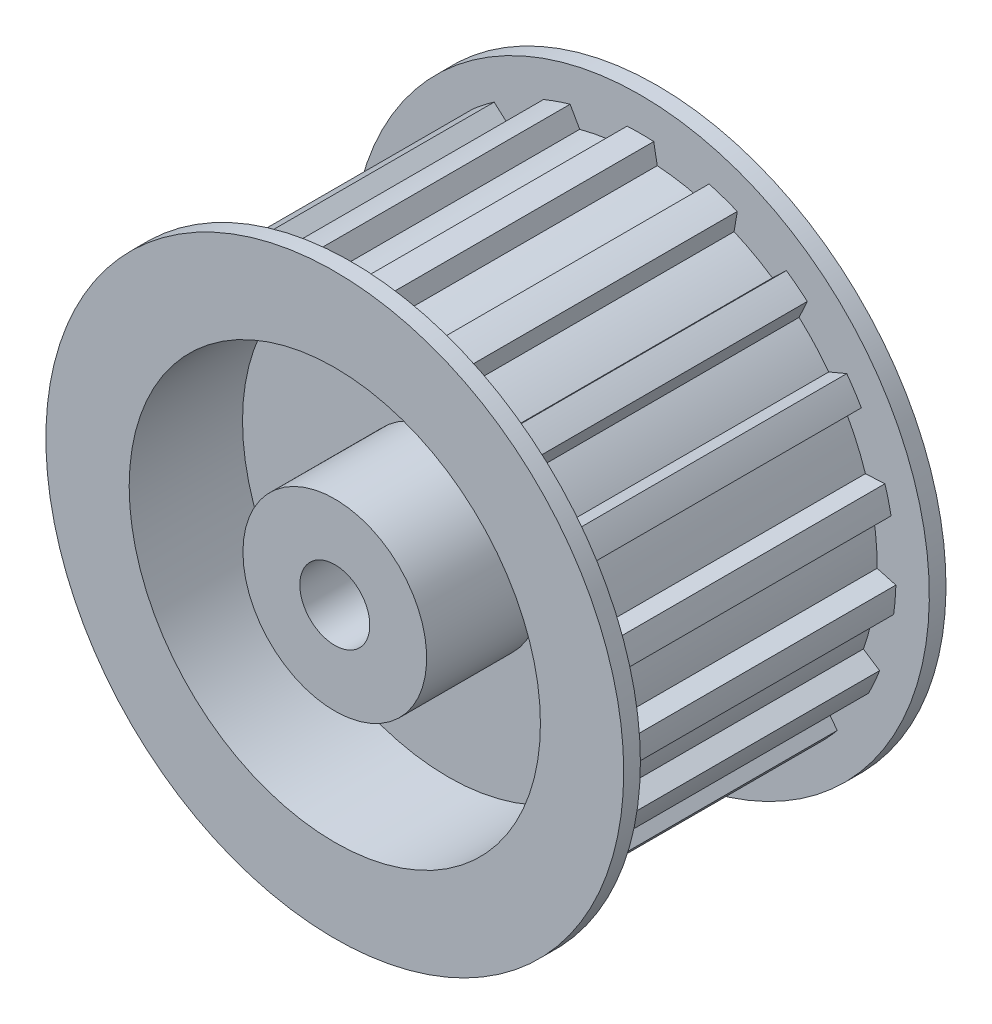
ISO-10303-21;
HEADER;
FILE_DESCRIPTION(('STEP AP214'),'2;1');
FILE_NAME('part.step','',(''),(''),'','','');
FILE_SCHEMA(('AUTOMOTIVE_DESIGN { 1 0 10303 214 1 1 1 1 }'));
ENDSEC;
DATA;
#1=APPLICATION_CONTEXT('core data for automotive mechanical design processes');
#2=APPLICATION_PROTOCOL_DEFINITION('international standard','automotive_design',2000,#1);
#3=PRODUCT_CONTEXT('',#1,'mechanical');
#4=PRODUCT('Part','Part','',(#3));
#5=PRODUCT_RELATED_PRODUCT_CATEGORY('part','',(#4));
#6=PRODUCT_DEFINITION_FORMATION('','',#4);
#7=PRODUCT_DEFINITION_CONTEXT('part definition',#1,'design');
#8=PRODUCT_DEFINITION('design','',#6,#7);
#9=PRODUCT_DEFINITION_SHAPE('','',#8);
#10=(LENGTH_UNIT() NAMED_UNIT(*) SI_UNIT(.MILLI.,.METRE.));
#11=(NAMED_UNIT(*) PLANE_ANGLE_UNIT() SI_UNIT($,.RADIAN.));
#12=(NAMED_UNIT(*) SI_UNIT($,.STERADIAN.) SOLID_ANGLE_UNIT());
#13=UNCERTAINTY_MEASURE_WITH_UNIT(LENGTH_MEASURE(1.E-05),#10,'distance_accuracy_value','');
#14=(GEOMETRIC_REPRESENTATION_CONTEXT(3) GLOBAL_UNCERTAINTY_ASSIGNED_CONTEXT((#13)) GLOBAL_UNIT_ASSIGNED_CONTEXT((#10,
#11,#12)) REPRESENTATION_CONTEXT('',''));
#15=CARTESIAN_POINT('',(0.,0.,0.));
#16=DIRECTION('',(0.,0.,1.));
#17=DIRECTION('',(1.,0.,0.));
#18=AXIS2_PLACEMENT_3D('',#15,#16,#17);
#19=CARTESIAN_POINT('',(0.,0.,-18.415));
#20=DIRECTION('',(0.,0.,1.));
#21=DIRECTION('',(0.,-1.,0.));
#22=AXIS2_PLACEMENT_3D('',#19,#20,#21);
#23=CYLINDRICAL_SURFACE('',#22,23.5);
#24=CARTESIAN_POINT('',(0.,0.,-18.415));
#25=DIRECTION('',(0.,0.,1.));
#26=DIRECTION('',(0.,-1.,0.));
#27=AXIS2_PLACEMENT_3D('',#24,#25,#26);
#28=CIRCLE('',#27,23.5);
#29=CARTESIAN_POINT('',(0.,-23.5,-18.415));
#30=VERTEX_POINT('',#29);
#31=EDGE_CURVE('E1024',#30,#30,#28,.F.);
#32=ORIENTED_EDGE('',*,*,#31,.T.);
#33=EDGE_LOOP('',(#32));
#34=FACE_BOUND('',#33,.T.);
#35=CARTESIAN_POINT('',(0.,0.,-5.461));
#36=DIRECTION('',(0.,0.,1.));
#37=DIRECTION('',(0.,-1.,0.));
#38=AXIS2_PLACEMENT_3D('',#35,#36,#37);
#39=CIRCLE('',#38,23.5);
#40=CARTESIAN_POINT('',(0.,-23.5,-5.461));
#41=VERTEX_POINT('',#40);
#42=EDGE_CURVE('E19',#41,#41,#39,.T.);
#43=ORIENTED_EDGE('',*,*,#42,.T.);
#44=EDGE_LOOP('',(#43));
#45=FACE_BOUND('',#44,.T.);
#46=ADVANCED_FACE('F15',(#34,#45),#23,.F.);
#47=CARTESIAN_POINT('',(23.97,23.97,-5.461));
#48=DIRECTION('',(0.,0.,1.));
#49=DIRECTION('',(-1.,0.,0.));
#50=AXIS2_PLACEMENT_3D('',#47,#48,#49);
#51=PLANE('',#50);
#52=CARTESIAN_POINT('',(0.,0.,-5.461));
#53=DIRECTION('',(0.,0.,1.));
#54=DIRECTION('',(0.,-1.,0.));
#55=AXIS2_PLACEMENT_3D('',#52,#53,#54);
#56=CIRCLE('',#55,10.5);
#57=CARTESIAN_POINT('',(0.,-10.5,-5.461));
#58=VERTEX_POINT('',#57);
#59=EDGE_CURVE('E1022',#58,#58,#56,.F.);
#60=ORIENTED_EDGE('',*,*,#59,.F.);
#61=EDGE_LOOP('',(#60));
#62=FACE_BOUND('',#61,.T.);
#63=ORIENTED_EDGE('',*,*,#42,.F.);
#64=EDGE_LOOP('',(#63));
#65=FACE_BOUND('',#64,.T.);
#66=ADVANCED_FACE('F1032',(#62,#65),#51,.F.);
#67=CARTESIAN_POINT('',(33.6804,33.6804,-18.415));
#68=DIRECTION('',(0.,0.,1.));
#69=DIRECTION('',(-1.,0.,0.));
#70=AXIS2_PLACEMENT_3D('',#67,#68,#69);
#71=PLANE('',#70);
#72=ORIENTED_EDGE('',*,*,#31,.F.);
#73=EDGE_LOOP('',(#72));
#74=FACE_BOUND('',#73,.T.);
#75=CARTESIAN_POINT('',(0.,0.,-18.415));
#76=DIRECTION('',(0.,0.,-1.));
#77=DIRECTION('',(0.,1.,0.));
#78=AXIS2_PLACEMENT_3D('',#75,#76,#77);
#79=CIRCLE('',#78,33.02);
#80=CARTESIAN_POINT('',(0.,33.02,-18.415));
#81=VERTEX_POINT('',#80);
#82=EDGE_CURVE('E1019',#81,#81,#79,.F.);
#83=ORIENTED_EDGE('',*,*,#82,.F.);
#84=EDGE_LOOP('',(#83));
#85=FACE_BOUND('',#84,.T.);
#86=ADVANCED_FACE('F1034',(#74,#85),#71,.F.);
#87=CARTESIAN_POINT('',(0.,0.,-18.415));
#88=DIRECTION('',(0.,0.,1.));
#89=DIRECTION('',(0.,-1.,0.));
#90=AXIS2_PLACEMENT_3D('',#87,#88,#89);
#91=CYLINDRICAL_SURFACE('',#90,10.5);
#92=CARTESIAN_POINT('',(0.,0.,-18.415));
#93=DIRECTION('',(0.,0.,1.));
#94=DIRECTION('',(0.,-1.,0.));
#95=AXIS2_PLACEMENT_3D('',#92,#93,#94);
#96=CIRCLE('',#95,10.5);
#97=CARTESIAN_POINT('',(0.,-10.5,-18.415));
#98=VERTEX_POINT('',#97);
#99=EDGE_CURVE('E1016',#98,#98,#96,.T.);
#100=ORIENTED_EDGE('',*,*,#99,.T.);
#101=EDGE_LOOP('',(#100));
#102=FACE_BOUND('',#101,.T.);
#103=ORIENTED_EDGE('',*,*,#59,.T.);
#104=EDGE_LOOP('',(#103));
#105=FACE_BOUND('',#104,.T.);
#106=ADVANCED_FACE('F1042',(#102,#105),#91,.T.);
#107=CARTESIAN_POINT('',(0.,0.,-16.51));
#108=DIRECTION('',(0.,0.,-1.));
#109=DIRECTION('',(0.,1.,0.));
#110=AXIS2_PLACEMENT_3D('',#107,#108,#109);
#111=CYLINDRICAL_SURFACE('',#110,33.02);
#112=CARTESIAN_POINT('',(0.,0.,-16.51));
#113=DIRECTION('',(0.,0.,-1.));
#114=DIRECTION('',(0.,1.,0.));
#115=AXIS2_PLACEMENT_3D('',#112,#113,#114);
#116=CIRCLE('',#115,33.02);
#117=CARTESIAN_POINT('',(0.,33.02,-16.51));
#118=VERTEX_POINT('',#117);
#119=EDGE_CURVE('E1013',#118,#118,#116,.F.);
#120=ORIENTED_EDGE('',*,*,#119,.F.);
#121=EDGE_LOOP('',(#120));
#122=FACE_BOUND('',#121,.T.);
#123=ORIENTED_EDGE('',*,*,#82,.T.);
#124=EDGE_LOOP('',(#123));
#125=FACE_BOUND('',#124,.T.);
#126=ADVANCED_FACE('F1392',(#122,#125),#111,.T.);
#127=CARTESIAN_POINT('',(10.71,10.71,-18.415));
#128=DIRECTION('',(0.,0.,1.));
#129=DIRECTION('',(-1.,0.,0.));
#130=AXIS2_PLACEMENT_3D('',#127,#128,#129);
#131=PLANE('',#130);
#132=CARTESIAN_POINT('',(0.,0.,-18.415));
#133=DIRECTION('',(0.,0.,-1.));
#134=DIRECTION('',(-1.,0.,0.));
#135=AXIS2_PLACEMENT_3D('',#132,#133,#134);
#136=CIRCLE('',#135,4.);
#137=CARTESIAN_POINT('',(-4.,0.,-18.415));
#138=VERTEX_POINT('',#137);
#139=EDGE_CURVE('E506',#138,#138,#136,.F.);
#140=ORIENTED_EDGE('',*,*,#139,.T.);
#141=EDGE_LOOP('',(#140));
#142=FACE_BOUND('',#141,.T.);
#143=ORIENTED_EDGE('',*,*,#99,.F.);
#144=EDGE_LOOP('',(#143));
#145=FACE_BOUND('',#144,.T.);
#146=ADVANCED_FACE('F1385',(#142,#145),#131,.F.);
#147=CARTESIAN_POINT('',(33.6804,33.6804,-16.51));
#148=DIRECTION('',(0.,0.,1.));
#149=DIRECTION('',(-1.,0.,0.));
#150=AXIS2_PLACEMENT_3D('',#147,#148,#149);
#151=PLANE('',#150);
#152=CARTESIAN_POINT('',(0.,0.,-16.51));
#153=DIRECTION('',(0.,0.,1.));
#154=DIRECTION('',(1.,0.,0.));
#155=AXIS2_PLACEMENT_3D('',#152,#153,#154);
#156=CIRCLE('',#155,27.0509993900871);
#157=CARTESIAN_POINT('',(-1.92741928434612,26.9822464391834,-16.51));
#158=VERTEX_POINT('',#157);
#159=CARTESIAN_POINT('',(-6.93813470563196,26.1461059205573,-16.51));
#160=VERTEX_POINT('',#159);
#161=EDGE_CURVE('E806',#158,#160,#156,.T.);
#162=ORIENTED_EDGE('',*,*,#161,.F.);
#163=DIRECTION('',(-0.181324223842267,-0.983423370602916,0.));
#164=VECTOR('',#163,1.);
#165=CARTESIAN_POINT('',(-1.92741928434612,26.9822464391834,-16.51));
#166=LINE('',#165,#164);
#167=CARTESIAN_POINT('',(-1.52399999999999,29.1702163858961,-16.51));
#168=VERTEX_POINT('',#167);
#169=EDGE_CURVE('E501',#168,#158,#166,.T.);
#170=ORIENTED_EDGE('',*,*,#169,.F.);
#171=CARTESIAN_POINT('',(0.,0.,-16.51));
#172=DIRECTION('',(0.,0.,1.));
#173=DIRECTION('',(1.,0.,0.));
#174=AXIS2_PLACEMENT_3D('',#171,#172,#173);
#175=CIRCLE('',#174,29.21);
#176=CARTESIAN_POINT('',(1.524,29.1702163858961,-16.51));
#177=VERTEX_POINT('',#176);
#178=EDGE_CURVE('E498',#177,#168,#175,.T.);
#179=ORIENTED_EDGE('',*,*,#178,.F.);
#180=DIRECTION('',(-0.181324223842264,0.983423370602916,0.));
#181=VECTOR('',#180,1.);
#182=CARTESIAN_POINT('',(1.524,29.1702163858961,-16.51));
#183=LINE('',#182,#181);
#184=CARTESIAN_POINT('',(1.92741928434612,26.9822464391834,-16.51));
#185=VERTEX_POINT('',#184);
#186=EDGE_CURVE('E486',#185,#177,#183,.T.);
#187=ORIENTED_EDGE('',*,*,#186,.F.);
#188=CARTESIAN_POINT('',(0.,0.,-16.51));
#189=DIRECTION('',(0.,0.,1.));
#190=DIRECTION('',(1.,0.,0.));
#191=AXIS2_PLACEMENT_3D('',#188,#189,#190);
#192=CIRCLE('',#191,27.0509993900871);
#193=CARTESIAN_POINT('',(6.93813470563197,26.1461059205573,-16.51));
#194=VERTEX_POINT('',#193);
#195=EDGE_CURVE('E521',#194,#185,#192,.T.);
#196=ORIENTED_EDGE('',*,*,#195,.F.);
#197=DIRECTION('',(-0.417295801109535,-0.908770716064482,0.));
#198=VECTOR('',#197,1.);
#199=CARTESIAN_POINT('',(6.93813470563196,26.1461059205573,-16.51));
#200=LINE('',#199,#198);
#201=CARTESIAN_POINT('',(7.85141826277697,28.1350196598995,-16.51));
#202=VERTEX_POINT('',#201);
#203=EDGE_CURVE('E522',#202,#194,#200,.T.);
#204=ORIENTED_EDGE('',*,*,#203,.F.);
#205=CARTESIAN_POINT('',(0.,0.,-16.51));
#206=DIRECTION('',(0.,0.,1.));
#207=DIRECTION('',(1.,0.,0.));
#208=AXIS2_PLACEMENT_3D('',#205,#206,#207);
#209=CIRCLE('',#208,29.21);
#210=CARTESIAN_POINT('',(11.0725078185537,27.0300512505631,-16.51));
#211=VERTEX_POINT('',#210);
#212=EDGE_CURVE('E526',#211,#202,#209,.T.);
#213=ORIENTED_EDGE('',*,*,#212,.F.);
#214=DIRECTION('',(0.164594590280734,0.986361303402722,0.));
#215=VECTOR('',#214,1.);
#216=CARTESIAN_POINT('',(11.0725078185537,27.0300512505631,-16.51));
#217=LINE('',#216,#215);
#218=CARTESIAN_POINT('',(10.7073348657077,24.8416897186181,-16.51));
#219=VERTEX_POINT('',#218);
#220=EDGE_CURVE('E530',#219,#211,#217,.T.);
#221=ORIENTED_EDGE('',*,*,#220,.F.);
#222=CARTESIAN_POINT('',(0.,0.,-16.51));
#223=DIRECTION('',(0.,0.,1.));
#224=DIRECTION('',(1.,0.,0.));
#225=AXIS2_PLACEMENT_3D('',#222,#223,#224);
#226=CIRCLE('',#225,27.0509993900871);
#227=CARTESIAN_POINT('',(15.0844039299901,22.4547840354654,-16.51));
#228=VERTEX_POINT('',#227);
#229=EDGE_CURVE('E534',#228,#219,#226,.T.);
#230=ORIENTED_EDGE('',*,*,#229,.F.);
#231=DIRECTION('',(-0.724166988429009,-0.689624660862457,0.));
#232=VECTOR('',#231,1.);
#233=CARTESIAN_POINT('',(15.0844039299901,22.4547840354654,-16.51));
#234=LINE('',#233,#232);
#235=CARTESIAN_POINT('',(16.6829866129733,23.9771152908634,-16.51));
#236=VERTEX_POINT('',#235);
#237=EDGE_CURVE('E538',#236,#228,#234,.T.);
#238=ORIENTED_EDGE('',*,*,#237,.F.);
#239=CARTESIAN_POINT('',(0.,0.,-16.51));
#240=DIRECTION('',(0.,0.,1.));
#241=DIRECTION('',(1.,0.,0.));
#242=AXIS2_PLACEMENT_3D('',#239,#240,#241);
#243=CIRCLE('',#242,29.21);
#244=CARTESIAN_POINT('',(19.07738962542,22.1196135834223,-16.51));
#245=VERTEX_POINT('',#244);
#246=EDGE_CURVE('E542',#245,#236,#243,.T.);
#247=ORIENTED_EDGE('',*,*,#246,.F.);
#248=DIRECTION('',(0.417295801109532,0.908770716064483,0.));
#249=VECTOR('',#248,1.);
#250=CARTESIAN_POINT('',(19.07738962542,22.1196135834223,-16.51));
#251=LINE('',#250,#249);
#252=CARTESIAN_POINT('',(18.1364655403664,20.0705053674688,-16.51));
#253=VERTEX_POINT('',#252);
#254=EDGE_CURVE('E546',#253,#245,#251,.T.);
#255=ORIENTED_EDGE('',*,*,#254,.F.);
#256=CARTESIAN_POINT('',(0.,0.,-16.51));
#257=DIRECTION('',(0.,0.,1.));
#258=DIRECTION('',(1.,0.,0.));
#259=AXIS2_PLACEMENT_3D('',#256,#257,#258);
#260=CIRCLE('',#259,27.0509993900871);
#261=CARTESIAN_POINT('',(21.5344337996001,16.3714608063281,-16.51));
#262=VERTEX_POINT('',#261);
#263=EDGE_CURVE('E550',#262,#253,#260,.T.);
#264=ORIENTED_EDGE('',*,*,#263,.F.);
#265=DIRECTION('',(-0.922464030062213,-0.386083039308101,0.));
#266=VECTOR('',#265,1.);
#267=CARTESIAN_POINT('',(21.5344337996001,16.3714608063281,-16.51));
#268=LINE('',#267,#266);
#269=CARTESIAN_POINT('',(23.5867783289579,17.2304378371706,-16.51));
#270=VERTEX_POINT('',#269);
#271=EDGE_CURVE('E554',#270,#262,#268,.T.);
#272=ORIENTED_EDGE('',*,*,#271,.F.);
#273=CARTESIAN_POINT('',(0.,0.,-16.51));
#274=DIRECTION('',(0.,0.,1.));
#275=DIRECTION('',(1.,0.,0.));
#276=AXIS2_PLACEMENT_3D('',#273,#274,#275);
#277=CIRCLE('',#276,29.21);
#278=CARTESIAN_POINT('',(25.2542665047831,14.6780830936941,-16.51));
#279=VERTEX_POINT('',#278);
#280=EDGE_CURVE('E558',#279,#270,#277,.T.);
#281=ORIENTED_EDGE('',*,*,#280,.F.);
#282=DIRECTION('',(0.724166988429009,0.689624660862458,0.));
#283=VECTOR('',#282,1.);
#284=CARTESIAN_POINT('',(25.2542665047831,14.6780830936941,-16.51));
#285=LINE('',#284,#283);
#286=CARTESIAN_POINT('',(23.6431241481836,13.1437912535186,-16.51));
#287=VERTEX_POINT('',#286);
#288=EDGE_CURVE('E562',#287,#279,#285,.T.);
#289=ORIENTED_EDGE('',*,*,#288,.F.);
#290=CARTESIAN_POINT('',(0.,0.,-16.51));
#291=DIRECTION('',(0.,0.,1.));
#292=DIRECTION('',(1.,0.,0.));
#293=AXIS2_PLACEMENT_3D('',#290,#291,#292);
#294=CIRCLE('',#293,27.0509993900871);
#295=CARTESIAN_POINT('',(25.7165817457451,8.39130450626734,-16.51));
#296=VERTEX_POINT('',#295);
#297=EDGE_CURVE('E566',#296,#287,#294,.T.);
#298=ORIENTED_EDGE('',*,*,#297,.F.);
#299=DIRECTION('',(-0.998638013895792,-0.052173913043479,0.));
#300=VECTOR('',#299,1.);
#301=CARTESIAN_POINT('',(25.7165817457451,8.39130450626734,-16.51));
#302=LINE('',#301,#300);
#303=CARTESIAN_POINT('',(27.9435845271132,8.50765442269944,-16.51));
#304=VERTEX_POINT('',#303);
#305=EDGE_CURVE('E570',#304,#296,#302,.T.);
#306=ORIENTED_EDGE('',*,*,#305,.F.);
#307=CARTESIAN_POINT('',(0.,0.,-16.51));
#308=DIRECTION('',(0.,0.,1.));
#309=DIRECTION('',(1.,0.,0.));
#310=AXIS2_PLACEMENT_3D('',#307,#308,#309);
#311=CIRCLE('',#310,29.21);
#312=CARTESIAN_POINT('',(28.651735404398,5.68349877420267,-16.51));
#313=VERTEX_POINT('',#312);
#314=EDGE_CURVE('E574',#313,#304,#311,.T.);
#315=ORIENTED_EDGE('',*,*,#314,.F.);
#316=DIRECTION('',(0.908818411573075,0.417191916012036,0.));
#317=VECTOR('',#316,1.);
#318=CARTESIAN_POINT('',(28.6517354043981,5.68349877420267,-16.51));
#319=LINE('',#318,#317);
#320=CARTESIAN_POINT('',(26.6297503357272,4.7553091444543,-16.51));
#321=VERTEX_POINT('',#320);
#322=EDGE_CURVE('E578',#321,#313,#319,.T.);
#323=ORIENTED_EDGE('',*,*,#322,.F.);
#324=CARTESIAN_POINT('',(0.,0.,-16.51));
#325=DIRECTION('',(0.,0.,1.));
#326=DIRECTION('',(1.,0.,0.));
#327=AXIS2_PLACEMENT_3D('',#324,#325,#326);
#328=CIRCLE('',#327,27.0509993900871);
#329=CARTESIAN_POINT('',(27.0492602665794,-0.306736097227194,-16.51));
#330=VERTEX_POINT('',#329);
#331=EDGE_CURVE('E582',#330,#321,#328,.T.);
#332=ORIENTED_EDGE('',*,*,#331,.F.);
#333=DIRECTION('',(-0.965110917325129,0.261841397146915,0.));
#334=VECTOR('',#333,1.);
#335=CARTESIAN_POINT('',(27.0492602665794,-0.306736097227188,-16.51));
#336=LINE('',#335,#334);
#337=CARTESIAN_POINT('',(29.1964598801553,-0.88928649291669,-16.51));
#338=VERTEX_POINT('',#337);
#339=EDGE_CURVE('E586',#338,#330,#336,.T.);
#340=ORIENTED_EDGE('',*,*,#339,.F.);
#341=CARTESIAN_POINT('',(0.,0.,-16.51));
#342=DIRECTION('',(0.,0.,1.));
#343=DIRECTION('',(1.,0.,0.));
#344=AXIS2_PLACEMENT_3D('',#341,#342,#343);
#345=CIRCLE('',#344,29.21);
#346=CARTESIAN_POINT('',(28.9447343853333,-3.92765214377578,-16.51));
#347=VERTEX_POINT('',#346);
#348=EDGE_CURVE('E590',#347,#338,#345,.T.);
#349=ORIENTED_EDGE('',*,*,#348,.F.);
#350=DIRECTION('',(0.997458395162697,0.071251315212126,0.));
#351=VECTOR('',#350,1.);
#352=CARTESIAN_POINT('',(28.9447343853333,-3.92765214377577,-16.51));
#353=LINE('',#352,#351);
#354=CARTESIAN_POINT('',(26.7407671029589,-4.08508785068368,-16.51));
#355=VERTEX_POINT('',#354);
#356=EDGE_CURVE('E594',#355,#347,#353,.T.);
#357=ORIENTED_EDGE('',*,*,#356,.F.);
#358=CARTESIAN_POINT('',(0.,0.,-16.51));
#359=DIRECTION('',(0.,0.,1.));
#360=DIRECTION('',(1.,0.,0.));
#361=AXIS2_PLACEMENT_3D('',#358,#359,#360);
#362=CIRCLE('',#361,27.0509993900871);
#363=CARTESIAN_POINT('',(25.4838570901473,-9.0735657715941,-16.51));
#364=VERTEX_POINT('',#363);
#365=EDGE_CURVE('E598',#364,#355,#362,.T.);
#366=ORIENTED_EDGE('',*,*,#365,.F.);
#367=DIRECTION('',(-0.836967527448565,0.547252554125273,0.));
#368=VECTOR('',#367,1.);
#369=CARTESIAN_POINT('',(25.4838570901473,-9.0735657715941,-16.51));
#370=LINE('',#369,#368);
#371=CARTESIAN_POINT('',(27.3388530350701,-10.2864578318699,-16.51));
#372=VERTEX_POINT('',#371);
#373=EDGE_CURVE('E602',#372,#364,#370,.T.);
#374=ORIENTED_EDGE('',*,*,#373,.F.);
#375=CARTESIAN_POINT('',(0.,0.,-16.51));
#376=DIRECTION('',(0.,0.,1.));
#377=DIRECTION('',(1.,0.,0.));
#378=AXIS2_PLACEMENT_3D('',#375,#376,#377);
#379=CIRCLE('',#378,29.21);
#380=CARTESIAN_POINT('',(26.084094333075,-13.1470195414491,-16.51));
#381=VERTEX_POINT('',#380);
#382=EDGE_CURVE('E606',#381,#372,#379,.T.);
#383=ORIENTED_EDGE('',*,*,#382,.F.);
#384=DIRECTION('',(0.965110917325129,-0.261841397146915,0.));
#385=VECTOR('',#384,1.);
#386=CARTESIAN_POINT('',(26.084094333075,-13.1470195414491,-16.51));
#387=LINE('',#386,#385);
#388=CARTESIAN_POINT('',(23.9536332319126,-12.5690104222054,-16.51));
#389=VERTEX_POINT('',#388);
#390=EDGE_CURVE('E610',#389,#381,#387,.T.);
#391=ORIENTED_EDGE('',*,*,#390,.F.);
#392=CARTESIAN_POINT('',(0.,0.,-16.51));
#393=DIRECTION('',(0.,0.,1.));
#394=DIRECTION('',(1.,0.,0.));
#395=AXIS2_PLACEMENT_3D('',#392,#393,#394);
#396=CIRCLE('',#395,27.0509993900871);
#397=CARTESIAN_POINT('',(21.1568894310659,-16.8565298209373,-16.51));
#398=VERTEX_POINT('',#397);
#399=EDGE_CURVE('E614',#398,#389,#396,.T.);
#400=ORIENTED_EDGE('',*,*,#399,.F.);
#401=DIRECTION('',(-0.600720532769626,0.799459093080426,0.));
#402=VECTOR('',#401,1.);
#403=CARTESIAN_POINT('',(21.1568894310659,-16.8565298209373,-16.51));
#404=LINE('',#403,#402);
#405=CARTESIAN_POINT('',(22.4934027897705,-18.6352067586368,-16.51));
#406=VERTEX_POINT('',#405);
#407=EDGE_CURVE('E618',#406,#398,#404,.T.);
#408=ORIENTED_EDGE('',*,*,#407,.F.);
#409=CARTESIAN_POINT('',(0.,0.,-16.51));
#410=DIRECTION('',(0.,0.,1.));
#411=DIRECTION('',(1.,0.,0.));
#412=AXIS2_PLACEMENT_3D('',#409,#410,#411);
#413=CIRCLE('',#412,29.21);
#414=CARTESIAN_POINT('',(20.4290485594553,-20.8776932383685,-16.51));
#415=VERTEX_POINT('',#414);
#416=EDGE_CURVE('E622',#415,#406,#413,.T.);
#417=ORIENTED_EDGE('',*,*,#416,.F.);
#418=DIRECTION('',(0.846335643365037,-0.532649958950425,0.));
#419=VECTOR('',#418,1.);
#420=CARTESIAN_POINT('',(20.4290485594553,-20.8776932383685,-16.51));
#421=LINE('',#420,#419);
#422=CARTESIAN_POINT('',(18.5460783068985,-19.6926267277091,-16.51));
#423=VERTEX_POINT('',#422);
#424=EDGE_CURVE('E626',#423,#415,#421,.T.);
#425=ORIENTED_EDGE('',*,*,#424,.F.);
#426=CARTESIAN_POINT('',(0.,0.,-16.51));
#427=DIRECTION('',(0.,0.,1.));
#428=DIRECTION('',(1.,0.,0.));
#429=AXIS2_PLACEMENT_3D('',#426,#427,#428);
#430=CIRCLE('',#429,27.0509993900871);
#431=CARTESIAN_POINT('',(14.5372445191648,-22.8128273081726,-16.51));
#432=VERTEX_POINT('',#431);
#433=EDGE_CURVE('E630',#432,#423,#430,.T.);
#434=ORIENTED_EDGE('',*,*,#433,.F.);
#435=DIRECTION('',(-0.308587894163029,0.951195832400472,0.));
#436=VECTOR('',#435,1.);
#437=CARTESIAN_POINT('',(14.5372445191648,-22.8128273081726,-16.51));
#438=LINE('',#437,#436);
#439=CARTESIAN_POINT('',(15.2238064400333,-24.9290958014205,-16.51));
#440=VERTEX_POINT('',#439);
#441=EDGE_CURVE('E634',#440,#432,#438,.T.);
#442=ORIENTED_EDGE('',*,*,#441,.F.);
#443=CARTESIAN_POINT('',(0.,0.,-16.51));
#444=DIRECTION('',(0.,0.,1.));
#445=DIRECTION('',(1.,0.,0.));
#446=AXIS2_PLACEMENT_3D('',#443,#444,#445);
#447=CIRCLE('',#446,29.21);
#448=CARTESIAN_POINT('',(12.5431704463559,-26.3797834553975,-16.51));
#449=VERTEX_POINT('',#448);
#450=EDGE_CURVE('E638',#449,#440,#447,.T.);
#451=ORIENTED_EDGE('',*,*,#450,.F.);
#452=DIRECTION('',(0.627527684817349,-0.778594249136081,0.));
#453=VECTOR('',#452,1.);
#454=CARTESIAN_POINT('',(12.5431704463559,-26.3797834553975,-16.51));
#455=LINE('',#454,#453);
#456=CARTESIAN_POINT('',(11.1470151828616,-24.6475276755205,-16.51));
#457=VERTEX_POINT('',#456);
#458=EDGE_CURVE('E642',#457,#449,#455,.T.);
#459=ORIENTED_EDGE('',*,*,#458,.F.);
#460=CARTESIAN_POINT('',(0.,0.,-16.51));
#461=DIRECTION('',(0.,0.,1.));
#462=DIRECTION('',(1.,0.,0.));
#463=AXIS2_PLACEMENT_3D('',#460,#461,#462);
#464=CIRCLE('',#463,27.0509993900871);
#465=CARTESIAN_POINT('',(6.34226359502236,-26.2970009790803,-16.51));
#466=VERTEX_POINT('',#465);
#467=EDGE_CURVE('E646',#466,#457,#464,.T.);
#468=ORIENTED_EDGE('',*,*,#467,.F.);
#469=DIRECTION('',(0.016985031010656,0.99985574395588,0.));
#470=VECTOR('',#469,1.);
#471=CARTESIAN_POINT('',(6.34226359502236,-26.2970009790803,-16.51));
#472=LINE('',#471,#470);
#473=CARTESIAN_POINT('',(6.30447444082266,-28.5215304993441,-16.51));
#474=VERTEX_POINT('',#473);
#475=EDGE_CURVE('E650',#474,#466,#472,.T.);
#476=ORIENTED_EDGE('',*,*,#475,.F.);
#477=CARTESIAN_POINT('',(0.,0.,-16.51));
#478=DIRECTION('',(0.,0.,1.));
#479=DIRECTION('',(1.,0.,0.));
#480=AXIS2_PLACEMENT_3D('',#477,#478,#479);
#481=CIRCLE('',#480,29.21);
#482=CARTESIAN_POINT('',(3.29804518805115,-29.0232148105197,-16.51));
#483=VERTEX_POINT('',#482);
#484=EDGE_CURVE('E654',#483,#474,#481,.T.);
#485=ORIENTED_EDGE('',*,*,#484,.F.);
#486=DIRECTION('',(0.340717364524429,-0.940165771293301,0.));
#487=VECTOR('',#486,1.);
#488=CARTESIAN_POINT('',(3.29804518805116,-29.0232148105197,-16.51));
#489=LINE('',#488,#487);
#490=CARTESIAN_POINT('',(2.54,-26.9314865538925,-16.51));
#491=VERTEX_POINT('',#490);
#492=EDGE_CURVE('E658',#491,#483,#489,.T.);
#493=ORIENTED_EDGE('',*,*,#492,.F.);
#494=CARTESIAN_POINT('',(0.,0.,-16.51));
#495=DIRECTION('',(0.,0.,1.));
#496=DIRECTION('',(1.,0.,0.));
#497=AXIS2_PLACEMENT_3D('',#494,#495,#496);
#498=CIRCLE('',#497,27.0509993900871);
#499=CARTESIAN_POINT('',(-2.54000000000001,-26.9314865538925,-16.51));
#500=VERTEX_POINT('',#499);
#501=EDGE_CURVE('E662',#500,#491,#498,.T.);
#502=ORIENTED_EDGE('',*,*,#501,.F.);
#503=DIRECTION('',(0.340717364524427,0.940165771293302,0.));
#504=VECTOR('',#503,1.);
#505=CARTESIAN_POINT('',(-2.54000000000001,-26.9314865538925,-16.51));
#506=LINE('',#505,#504);
#507=CARTESIAN_POINT('',(-3.29804518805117,-29.0232148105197,-16.51));
#508=VERTEX_POINT('',#507);
#509=EDGE_CURVE('E666',#508,#500,#506,.T.);
#510=ORIENTED_EDGE('',*,*,#509,.F.);
#511=CARTESIAN_POINT('',(0.,0.,-16.51));
#512=DIRECTION('',(0.,0.,1.));
#513=DIRECTION('',(1.,0.,0.));
#514=AXIS2_PLACEMENT_3D('',#511,#512,#513);
#515=CIRCLE('',#514,29.21);
#516=CARTESIAN_POINT('',(-6.30447444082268,-28.5215304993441,-16.51));
#517=VERTEX_POINT('',#516);
#518=EDGE_CURVE('E670',#517,#508,#515,.T.);
#519=ORIENTED_EDGE('',*,*,#518,.F.);
#520=DIRECTION('',(0.016985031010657,-0.99985574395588,0.));
#521=VECTOR('',#520,1.);
#522=CARTESIAN_POINT('',(-6.30447444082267,-28.5215304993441,-16.51));
#523=LINE('',#522,#521);
#524=CARTESIAN_POINT('',(-6.34226359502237,-26.2970009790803,-16.51));
#525=VERTEX_POINT('',#524);
#526=EDGE_CURVE('E674',#525,#517,#523,.T.);
#527=ORIENTED_EDGE('',*,*,#526,.F.);
#528=CARTESIAN_POINT('',(0.,0.,-16.51));
#529=DIRECTION('',(0.,0.,1.));
#530=DIRECTION('',(1.,0.,0.));
#531=AXIS2_PLACEMENT_3D('',#528,#529,#530);
#532=CIRCLE('',#531,27.0509993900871);
#533=CARTESIAN_POINT('',(-11.1827363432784,-24.6313413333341,-16.51));
#534=VERTEX_POINT('',#533);
#535=EDGE_CURVE('E678',#534,#525,#532,.T.);
#536=ORIENTED_EDGE('',*,*,#535,.F.);
#537=DIRECTION('',(0.600781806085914,0.799413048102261,0.));
#538=VECTOR('',#537,1.);
#539=CARTESIAN_POINT('',(-11.1827363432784,-24.6313413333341,-16.51));
#540=LINE('',#539,#538);
#541=CARTESIAN_POINT('',(-12.5089489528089,-26.3960280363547,-16.51));
#542=VERTEX_POINT('',#541);
#543=EDGE_CURVE('E682',#542,#534,#540,.T.);
#544=ORIENTED_EDGE('',*,*,#543,.F.);
#545=CARTESIAN_POINT('',(0.,0.,-16.51));
#546=DIRECTION('',(0.,0.,1.));
#547=DIRECTION('',(1.,0.,0.));
#548=AXIS2_PLACEMENT_3D('',#545,#546,#547);
#549=CIRCLE('',#548,29.21);
#550=CARTESIAN_POINT('',(-15.2238064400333,-24.9290958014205,-16.51));
#551=VERTEX_POINT('',#550);
#552=EDGE_CURVE('E686',#551,#542,#549,.T.);
#553=ORIENTED_EDGE('',*,*,#552,.F.);
#554=DIRECTION('',(-0.30858789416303,-0.951195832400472,0.));
#555=VECTOR('',#554,1.);
#556=CARTESIAN_POINT('',(-15.2238064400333,-24.9290958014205,-16.51));
#557=LINE('',#556,#555);
#558=CARTESIAN_POINT('',(-14.5372445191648,-22.8128273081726,-16.51));
#559=VERTEX_POINT('',#558);
#560=EDGE_CURVE('E690',#559,#551,#557,.T.);
#561=ORIENTED_EDGE('',*,*,#560,.F.);
#562=CARTESIAN_POINT('',(0.,0.,-16.51));
#563=DIRECTION('',(0.,0.,1.));
#564=DIRECTION('',(1.,0.,0.));
#565=AXIS2_PLACEMENT_3D('',#562,#563,#564);
#566=CIRCLE('',#565,27.0509993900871);
#567=CARTESIAN_POINT('',(-18.5460783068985,-19.6926267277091,-16.51));
#568=VERTEX_POINT('',#567);
#569=EDGE_CURVE('E694',#568,#559,#566,.T.);
#570=ORIENTED_EDGE('',*,*,#569,.F.);
#571=DIRECTION('',(0.846335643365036,0.532649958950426,0.));
#572=VECTOR('',#571,1.);
#573=CARTESIAN_POINT('',(-18.5460783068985,-19.6926267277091,-16.51));
#574=LINE('',#573,#572);
#575=CARTESIAN_POINT('',(-20.4290485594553,-20.8776932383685,-16.51));
#576=VERTEX_POINT('',#575);
#577=EDGE_CURVE('E698',#576,#568,#574,.T.);
#578=ORIENTED_EDGE('',*,*,#577,.F.);
#579=CARTESIAN_POINT('',(0.,0.,-16.51));
#580=DIRECTION('',(0.,0.,1.));
#581=DIRECTION('',(1.,0.,0.));
#582=AXIS2_PLACEMENT_3D('',#579,#580,#581);
#583=CIRCLE('',#582,29.21);
#584=CARTESIAN_POINT('',(-22.4938981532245,-18.6346088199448,-16.51));
#585=VERTEX_POINT('',#584);
#586=EDGE_CURVE('E702',#585,#576,#583,.T.);
#587=ORIENTED_EDGE('',*,*,#586,.F.);
#588=DIRECTION('',(-0.600781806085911,-0.799413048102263,0.));
#589=VECTOR('',#588,1.);
#590=CARTESIAN_POINT('',(-22.4938981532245,-18.6346088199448,-16.51));
#591=LINE('',#590,#589);
#592=CARTESIAN_POINT('',(-21.1572658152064,-16.8560574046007,-16.51));
#593=VERTEX_POINT('',#592);
#594=EDGE_CURVE('E706',#593,#585,#591,.T.);
#595=ORIENTED_EDGE('',*,*,#594,.F.);
#596=CARTESIAN_POINT('',(0.,0.,-16.51));
#597=DIRECTION('',(0.,0.,1.));
#598=DIRECTION('',(1.,0.,0.));
#599=AXIS2_PLACEMENT_3D('',#596,#597,#598);
#600=CIRCLE('',#599,27.0509993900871);
#601=CARTESIAN_POINT('',(-23.9353860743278,-12.6037241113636,-16.51));
#602=VERTEX_POINT('',#601);
#603=EDGE_CURVE('E710',#602,#593,#600,.T.);
#604=ORIENTED_EDGE('',*,*,#603,.F.);
#605=DIRECTION('',(0.97343000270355,0.228984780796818,0.));
#606=VECTOR('',#605,1.);
#607=CARTESIAN_POINT('',(-23.9353860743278,-12.6037241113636,-16.51));
#608=LINE('',#607,#606);
#609=CARTESIAN_POINT('',(-26.1011222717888,-13.1131810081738,-16.51));
#610=VERTEX_POINT('',#609);
#611=EDGE_CURVE('E714',#610,#602,#608,.T.);
#612=ORIENTED_EDGE('',*,*,#611,.F.);
#613=CARTESIAN_POINT('',(0.,0.,-16.51));
#614=DIRECTION('',(0.,0.,1.));
#615=DIRECTION('',(1.,0.,0.));
#616=AXIS2_PLACEMENT_3D('',#613,#614,#615);
#617=CIRCLE('',#616,29.21);
#618=CARTESIAN_POINT('',(-27.325489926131,-10.3219039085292,-16.51));
#619=VERTEX_POINT('',#618);
#620=EDGE_CURVE('E718',#619,#610,#617,.T.);
#621=ORIENTED_EDGE('',*,*,#620,.F.);
#622=DIRECTION('',(-0.827755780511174,-0.561088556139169,0.));
#623=VECTOR('',#622,1.);
#624=CARTESIAN_POINT('',(-27.325489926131,-10.3219039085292,-16.51));
#625=LINE('',#624,#623);
#626=CARTESIAN_POINT('',(-25.4838570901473,-9.07356577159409,-16.51));
#627=VERTEX_POINT('',#626);
#628=EDGE_CURVE('E722',#627,#619,#625,.T.);
#629=ORIENTED_EDGE('',*,*,#628,.F.);
#630=CARTESIAN_POINT('',(0.,0.,-16.51));
#631=DIRECTION('',(0.,0.,1.));
#632=DIRECTION('',(1.,0.,0.));
#633=AXIS2_PLACEMENT_3D('',#630,#631,#632);
#634=CIRCLE('',#633,27.0509993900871);
#635=CARTESIAN_POINT('',(-26.7308307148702,-4.14960929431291,-16.51));
#636=VERTEX_POINT('',#635);
#637=EDGE_CURVE('E726',#636,#627,#634,.T.);
#638=ORIENTED_EDGE('',*,*,#637,.F.);
#639=DIRECTION('',(0.995045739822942,-0.099418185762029,0.));
#640=VECTOR('',#639,1.);
#641=CARTESIAN_POINT('',(-26.7308307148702,-4.14960929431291,-16.51));
#642=LINE('',#641,#640);
#643=CARTESIAN_POINT('',(-28.9446299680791,-3.92842156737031,-16.51));
#644=VERTEX_POINT('',#643);
#645=EDGE_CURVE('E730',#644,#636,#642,.T.);
#646=ORIENTED_EDGE('',*,*,#645,.F.);
#647=CARTESIAN_POINT('',(0.,0.,-16.51));
#648=DIRECTION('',(0.,0.,1.));
#649=DIRECTION('',(1.,0.,0.));
#650=AXIS2_PLACEMENT_3D('',#647,#648,#649);
#651=CIRCLE('',#650,29.21);
#652=CARTESIAN_POINT('',(-29.1964362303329,-0.890062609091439,-16.51));
#653=VERTEX_POINT('',#652);
#654=EDGE_CURVE('E734',#653,#644,#651,.T.);
#655=ORIENTED_EDGE('',*,*,#654,.F.);
#656=DIRECTION('',(-0.965090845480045,-0.261915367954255,0.));
#657=VECTOR('',#656,1.);
#658=CARTESIAN_POINT('',(-29.1964362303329,-0.890062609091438,-16.51));
#659=LINE('',#658,#657);
#660=CARTESIAN_POINT('',(-27.0492534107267,-0.307340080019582,-16.51));
#661=VERTEX_POINT('',#660);
#662=EDGE_CURVE('E738',#661,#653,#659,.T.);
#663=ORIENTED_EDGE('',*,*,#662,.F.);
#664=CARTESIAN_POINT('',(0.,0.,-16.51));
#665=DIRECTION('',(0.,0.,1.));
#666=DIRECTION('',(1.,0.,0.));
#667=AXIS2_PLACEMENT_3D('',#664,#665,#666);
#668=CIRCLE('',#667,27.0509993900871);
#669=CARTESIAN_POINT('',(-26.6295919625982,4.75619594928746,-16.51));
#670=VERTEX_POINT('',#669);
#671=EDGE_CURVE('E742',#670,#661,#668,.T.);
#672=ORIENTED_EDGE('',*,*,#671,.F.);
#673=DIRECTION('',(0.908770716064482,-0.417295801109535,0.));
#674=VECTOR('',#673,1.);
#675=CARTESIAN_POINT('',(-26.6295919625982,4.75619594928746,-16.51));
#676=LINE('',#675,#674);
#677=CARTESIAN_POINT('',(-28.6515100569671,5.68463468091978,-16.51));
#678=VERTEX_POINT('',#677);
#679=EDGE_CURVE('E746',#678,#670,#676,.T.);
#680=ORIENTED_EDGE('',*,*,#679,.F.);
#681=CARTESIAN_POINT('',(0.,0.,-16.51));
#682=DIRECTION('',(0.,0.,1.));
#683=DIRECTION('',(1.,0.,0.));
#684=AXIS2_PLACEMENT_3D('',#681,#682,#683);
#685=CIRCLE('',#684,29.21);
#686=CARTESIAN_POINT('',(-27.8922695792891,8.67441051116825,-16.51));
#687=VERTEX_POINT('',#686);
#688=EDGE_CURVE('E750',#687,#678,#685,.T.);
#689=ORIENTED_EDGE('',*,*,#688,.F.);
#690=DIRECTION('',(-0.995045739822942,0.099418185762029,0.));
#691=VECTOR('',#690,1.);
#692=CARTESIAN_POINT('',(-27.8922695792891,8.67441051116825,-16.51));
#693=LINE('',#692,#691);
#694=CARTESIAN_POINT('',(-25.6957280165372,8.4549470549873,-16.51));
#695=VERTEX_POINT('',#694);
#696=EDGE_CURVE('E754',#695,#687,#693,.T.);
#697=ORIENTED_EDGE('',*,*,#696,.F.);
#698=CARTESIAN_POINT('',(0.,0.,-16.51));
#699=DIRECTION('',(0.,0.,1.));
#700=DIRECTION('',(1.,0.,0.));
#701=AXIS2_PLACEMENT_3D('',#698,#699,#700);
#702=CIRCLE('',#701,27.0509993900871);
#703=CARTESIAN_POINT('',(-23.6428306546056,13.1443191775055,-16.51));
#704=VERTEX_POINT('',#703);
#705=EDGE_CURVE('E758',#704,#695,#702,.T.);
#706=ORIENTED_EDGE('',*,*,#705,.F.);
#707=DIRECTION('',(0.724114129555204,-0.689680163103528,0.));
#708=VECTOR('',#707,1.);
#709=CARTESIAN_POINT('',(-23.6428306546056,13.1443191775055,-16.51));
#710=LINE('',#709,#708);
#711=CARTESIAN_POINT('',(-25.2538763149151,14.6787544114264,-16.51));
#712=VERTEX_POINT('',#711);
#713=EDGE_CURVE('E762',#712,#704,#710,.T.);
#714=ORIENTED_EDGE('',*,*,#713,.F.);
#715=CARTESIAN_POINT('',(0.,0.,-16.51));
#716=DIRECTION('',(0.,0.,1.));
#717=DIRECTION('',(1.,0.,0.));
#718=AXIS2_PLACEMENT_3D('',#715,#716,#717);
#719=CIRCLE('',#718,29.21);
#720=CARTESIAN_POINT('',(-23.5867783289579,17.2304378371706,-16.51));
#721=VERTEX_POINT('',#720);
#722=EDGE_CURVE('E766',#721,#712,#719,.T.);
#723=ORIENTED_EDGE('',*,*,#722,.F.);
#724=DIRECTION('',(-0.922464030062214,0.386083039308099,0.));
#725=VECTOR('',#724,1.);
#726=CARTESIAN_POINT('',(-23.5867783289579,17.2304378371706,-16.51));
#727=LINE('',#726,#725);
#728=CARTESIAN_POINT('',(-21.5344337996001,16.3714608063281,-16.51));
#729=VERTEX_POINT('',#728);
#730=EDGE_CURVE('E770',#729,#721,#727,.T.);
#731=ORIENTED_EDGE('',*,*,#730,.F.);
#732=CARTESIAN_POINT('',(0.,0.,-16.51));
#733=DIRECTION('',(0.,0.,1.));
#734=DIRECTION('',(1.,0.,0.));
#735=AXIS2_PLACEMENT_3D('',#732,#733,#734);
#736=CIRCLE('',#735,27.0509993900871);
#737=CARTESIAN_POINT('',(-18.0938434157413,20.1089382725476,-16.51));
#738=VERTEX_POINT('',#737);
#739=EDGE_CURVE('E774',#738,#729,#736,.T.);
#740=ORIENTED_EDGE('',*,*,#739,.F.);
#741=DIRECTION('',(0.460940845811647,-0.887430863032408,0.));
#742=VECTOR('',#741,1.);
#743=CARTESIAN_POINT('',(-18.0938434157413,20.1089382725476,-16.51));
#744=LINE('',#743,#742);
#745=CARTESIAN_POINT('',(-19.1193678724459,22.08333924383,-16.51));
#746=VERTEX_POINT('',#745);
#747=EDGE_CURVE('E778',#746,#738,#744,.T.);
#748=ORIENTED_EDGE('',*,*,#747,.F.);
#749=CARTESIAN_POINT('',(0.,0.,-16.51));
#750=DIRECTION('',(0.,0.,1.));
#751=DIRECTION('',(1.,0.,0.));
#752=AXIS2_PLACEMENT_3D('',#749,#750,#751);
#753=CIRCLE('',#752,29.21);
#754=CARTESIAN_POINT('',(-16.7140675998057,23.9554595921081,-16.51));
#755=VERTEX_POINT('',#754);
#756=EDGE_CURVE('E782',#755,#746,#753,.T.);
#757=ORIENTED_EDGE('',*,*,#756,.F.);
#758=DIRECTION('',(-0.747121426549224,0.664687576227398,0.));
#759=VECTOR('',#758,1.);
#760=CARTESIAN_POINT('',(-16.7140675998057,23.9554595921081,-16.51));
#761=LINE('',#760,#759);
#762=CARTESIAN_POINT('',(-15.0518341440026,22.4766291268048,-16.51));
#763=VERTEX_POINT('',#762);
#764=EDGE_CURVE('E786',#763,#755,#761,.T.);
#765=ORIENTED_EDGE('',*,*,#764,.F.);
#766=CARTESIAN_POINT('',(0.,0.,-16.51));
#767=DIRECTION('',(0.,0.,1.));
#768=DIRECTION('',(1.,0.,0.));
#769=AXIS2_PLACEMENT_3D('',#766,#767,#768);
#770=CIRCLE('',#769,27.0509993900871);
#771=CARTESIAN_POINT('',(-10.7073348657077,24.8416897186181,-16.51));
#772=VERTEX_POINT('',#771);
#773=EDGE_CURVE('E790',#772,#763,#770,.T.);
#774=ORIENTED_EDGE('',*,*,#773,.F.);
#775=DIRECTION('',(0.164594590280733,-0.986361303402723,0.));
#776=VECTOR('',#775,1.);
#777=CARTESIAN_POINT('',(-10.7073348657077,24.8416897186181,-16.51));
#778=LINE('',#777,#776);
#779=CARTESIAN_POINT('',(-11.0725078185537,27.0300512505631,-16.51));
#780=VERTEX_POINT('',#779);
#781=EDGE_CURVE('E794',#780,#772,#778,.T.);
#782=ORIENTED_EDGE('',*,*,#781,.F.);
#783=CARTESIAN_POINT('',(0.,0.,-16.51));
#784=DIRECTION('',(0.,0.,1.));
#785=DIRECTION('',(1.,0.,0.));
#786=AXIS2_PLACEMENT_3D('',#783,#784,#785);
#787=CIRCLE('',#786,29.21);
#788=CARTESIAN_POINT('',(-8.03012830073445,28.0845355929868,-16.51));
#789=VERTEX_POINT('',#788);
#790=EDGE_CURVE('E798',#789,#780,#787,.T.);
#791=ORIENTED_EDGE('',*,*,#790,.F.);
#792=DIRECTION('',(-0.490816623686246,0.871262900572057,0.));
#793=VECTOR('',#792,1.);
#794=CARTESIAN_POINT('',(-8.03012830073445,28.0845355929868,-16.51));
#795=LINE('',#794,#793);
#796=EDGE_CURVE('E802',#160,#789,#795,.T.);
#797=ORIENTED_EDGE('',*,*,#796,.F.);
#798=EDGE_LOOP('',(#162,#170,#179,#187,#196,#204,#213,#221,#230,#238,#247,#255,#264,#272,#281,
#289,#298,#306,#315,#323,#332,#340,#349,#357,#366,#374,#383,#391,#400,#408,#417,#425,#434,#442,
#451,#459,#468,#476,#485,#493,#502,#510,#519,#527,#536,#544,#553,#561,#570,#578,#587,#595,#604,
#612,#621,#629,#638,#646,#655,#663,#672,#680,#689,#697,#706,#714,#723,#731,#740,#748,#757,#765,
#774,#782,#791,#797));
#799=FACE_BOUND('',#798,.T.);
#800=ORIENTED_EDGE('',*,*,#119,.T.);
#801=EDGE_LOOP('',(#800));
#802=FACE_BOUND('',#801,.T.);
#803=ADVANCED_FACE('F17',(#799,#802),#151,.T.);
#804=CARTESIAN_POINT('',(0.,0.,18.415));
#805=DIRECTION('',(0.,0.,-1.));
#806=DIRECTION('',(-1.,0.,0.));
#807=AXIS2_PLACEMENT_3D('',#804,#805,#806);
#808=CYLINDRICAL_SURFACE('',#807,4.);
#809=CARTESIAN_POINT('',(0.,0.,18.415));
#810=DIRECTION('',(0.,0.,-1.));
#811=DIRECTION('',(-1.,0.,0.));
#812=AXIS2_PLACEMENT_3D('',#809,#810,#811);
#813=CIRCLE('',#812,4.);
#814=CARTESIAN_POINT('',(-4.,0.,18.415));
#815=VERTEX_POINT('',#814);
#816=EDGE_CURVE('E511',#815,#815,#813,.F.);
#817=ORIENTED_EDGE('',*,*,#816,.T.);
#818=EDGE_LOOP('',(#817));
#819=FACE_BOUND('',#818,.T.);
#820=ORIENTED_EDGE('',*,*,#139,.F.);
#821=EDGE_LOOP('',(#820));
#822=FACE_BOUND('',#821,.T.);
#823=ADVANCED_FACE('F1379',(#819,#822),#808,.F.);
#824=CARTESIAN_POINT('',(0.,0.,0.));
#825=DIRECTION('',(0.,0.,1.));
#826=DIRECTION('',(1.,0.,0.));
#827=AXIS2_PLACEMENT_3D('',#824,#825,#826);
#828=CYLINDRICAL_SURFACE('',#827,29.21);
#829=ORIENTED_EDGE('',*,*,#178,.T.);
#830=DIRECTION('',(0.,0.,1.));
#831=VECTOR('',#830,1.);
#832=CARTESIAN_POINT('',(-1.52399999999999,29.1702163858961,0.));
#833=LINE('',#832,#831);
#834=CARTESIAN_POINT('',(-1.52399999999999,29.1702163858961,16.51));
#835=VERTEX_POINT('',#834);
#836=EDGE_CURVE('E505',#835,#168,#833,.F.);
#837=ORIENTED_EDGE('',*,*,#836,.F.);
#838=CARTESIAN_POINT('',(0.,0.,16.51));
#839=DIRECTION('',(0.,0.,1.));
#840=DIRECTION('',(1.,0.,0.));
#841=AXIS2_PLACEMENT_3D('',#838,#839,#840);
#842=CIRCLE('',#841,29.21);
#843=CARTESIAN_POINT('',(1.524,29.1702163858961,16.51));
#844=VERTEX_POINT('',#843);
#845=EDGE_CURVE('E510',#844,#835,#842,.T.);
#846=ORIENTED_EDGE('',*,*,#845,.F.);
#847=DIRECTION('',(0.,0.,1.));
#848=VECTOR('',#847,1.);
#849=CARTESIAN_POINT('',(1.524,29.1702163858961,0.));
#850=LINE('',#849,#848);
#851=EDGE_CURVE('E491',#177,#844,#850,.T.);
#852=ORIENTED_EDGE('',*,*,#851,.F.);
#853=EDGE_LOOP('',(#829,#837,#846,#852));
#854=FACE_BOUND('',#853,.T.);
#855=ADVANCED_FACE('F509',(#854),#828,.T.);
#856=CARTESIAN_POINT('',(-1.92741928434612,26.9822464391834,0.));
#857=DIRECTION('',(-0.983423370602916,0.181324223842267,0.));
#858=DIRECTION('',(-0.181324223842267,-0.983423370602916,0.));
#859=AXIS2_PLACEMENT_3D('',#856,#857,#858);
#860=PLANE('',#859);
#861=ORIENTED_EDGE('',*,*,#169,.T.);
#862=DIRECTION('',(0.,0.,1.));
#863=VECTOR('',#862,1.);
#864=CARTESIAN_POINT('',(-1.92741928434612,26.9822464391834,0.));
#865=LINE('',#864,#863);
#866=CARTESIAN_POINT('',(-1.92741928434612,26.9822464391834,16.51));
#867=VERTEX_POINT('',#866);
#868=EDGE_CURVE('E807',#867,#158,#865,.F.);
#869=ORIENTED_EDGE('',*,*,#868,.F.);
#870=DIRECTION('',(-0.181324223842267,-0.983423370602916,0.));
#871=VECTOR('',#870,1.);
#872=CARTESIAN_POINT('',(-1.52399999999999,29.1702163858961,16.51));
#873=LINE('',#872,#871);
#874=EDGE_CURVE('E972',#835,#867,#873,.T.);
#875=ORIENTED_EDGE('',*,*,#874,.F.);
#876=ORIENTED_EDGE('',*,*,#836,.T.);
#877=EDGE_LOOP('',(#861,#869,#875,#876));
#878=FACE_BOUND('',#877,.T.);
#879=ADVANCED_FACE('F1372',(#878),#860,.T.);
#880=CARTESIAN_POINT('',(0.,0.,0.));
#881=DIRECTION('',(0.,0.,1.));
#882=DIRECTION('',(1.,0.,0.));
#883=AXIS2_PLACEMENT_3D('',#880,#881,#882);
#884=CYLINDRICAL_SURFACE('',#883,27.0509993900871);
#885=ORIENTED_EDGE('',*,*,#161,.T.);
#886=DIRECTION('',(0.,0.,1.));
#887=VECTOR('',#886,1.);
#888=CARTESIAN_POINT('',(-6.93813470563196,26.1461059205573,0.));
#889=LINE('',#888,#887);
#890=CARTESIAN_POINT('',(-6.93813470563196,26.1461059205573,16.51));
#891=VERTEX_POINT('',#890);
#892=EDGE_CURVE('E803',#891,#160,#889,.F.);
#893=ORIENTED_EDGE('',*,*,#892,.F.);
#894=CARTESIAN_POINT('',(0.,0.,16.51));
#895=DIRECTION('',(0.,0.,1.));
#896=DIRECTION('',(1.,0.,0.));
#897=AXIS2_PLACEMENT_3D('',#894,#895,#896);
#898=CIRCLE('',#897,27.0509993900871);
#899=EDGE_CURVE('E970',#867,#891,#898,.T.);
#900=ORIENTED_EDGE('',*,*,#899,.F.);
#901=ORIENTED_EDGE('',*,*,#868,.T.);
#902=EDGE_LOOP('',(#885,#893,#900,#901));
#903=FACE_BOUND('',#902,.T.);
#904=ADVANCED_FACE('F1368',(#903),#884,.T.);
#905=CARTESIAN_POINT('',(-8.03012830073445,28.0845355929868,0.));
#906=DIRECTION('',(0.871262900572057,0.490816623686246,0.));
#907=DIRECTION('',(-0.490816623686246,0.871262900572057,0.));
#908=AXIS2_PLACEMENT_3D('',#905,#906,#907);
#909=PLANE('',#908);
#910=ORIENTED_EDGE('',*,*,#796,.T.);
#911=DIRECTION('',(0.,0.,1.));
#912=VECTOR('',#911,1.);
#913=CARTESIAN_POINT('',(-8.03012830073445,28.0845355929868,0.));
#914=LINE('',#913,#912);
#915=CARTESIAN_POINT('',(-8.03012830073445,28.0845355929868,16.51));
#916=VERTEX_POINT('',#915);
#917=EDGE_CURVE('E799',#916,#789,#914,.F.);
#918=ORIENTED_EDGE('',*,*,#917,.F.);
#919=DIRECTION('',(-0.490816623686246,0.871262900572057,0.));
#920=VECTOR('',#919,1.);
#921=CARTESIAN_POINT('',(-6.93813470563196,26.1461059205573,16.51));
#922=LINE('',#921,#920);
#923=EDGE_CURVE('E969',#891,#916,#922,.T.);
#924=ORIENTED_EDGE('',*,*,#923,.F.);
#925=ORIENTED_EDGE('',*,*,#892,.T.);
#926=EDGE_LOOP('',(#910,#918,#924,#925));
#927=FACE_BOUND('',#926,.T.);
#928=ADVANCED_FACE('F1364',(#927),#909,.T.);
#929=CARTESIAN_POINT('',(0.,0.,0.));
#930=DIRECTION('',(0.,0.,1.));
#931=DIRECTION('',(1.,0.,0.));
#932=AXIS2_PLACEMENT_3D('',#929,#930,#931);
#933=CYLINDRICAL_SURFACE('',#932,29.21);
#934=ORIENTED_EDGE('',*,*,#790,.T.);
#935=DIRECTION('',(0.,0.,1.));
#936=VECTOR('',#935,1.);
#937=CARTESIAN_POINT('',(-11.0725078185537,27.0300512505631,0.));
#938=LINE('',#937,#936);
#939=CARTESIAN_POINT('',(-11.0725078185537,27.0300512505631,16.51));
#940=VERTEX_POINT('',#939);
#941=EDGE_CURVE('E795',#940,#780,#938,.F.);
#942=ORIENTED_EDGE('',*,*,#941,.F.);
#943=CARTESIAN_POINT('',(0.,0.,16.51));
#944=DIRECTION('',(0.,0.,1.));
#945=DIRECTION('',(1.,0.,0.));
#946=AXIS2_PLACEMENT_3D('',#943,#944,#945);
#947=CIRCLE('',#946,29.21);
#948=EDGE_CURVE('E967',#916,#940,#947,.T.);
#949=ORIENTED_EDGE('',*,*,#948,.F.);
#950=ORIENTED_EDGE('',*,*,#917,.T.);
#951=EDGE_LOOP('',(#934,#942,#949,#950));
#952=FACE_BOUND('',#951,.T.);
#953=ADVANCED_FACE('F1360',(#952),#933,.T.);
#954=CARTESIAN_POINT('',(-10.7073348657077,24.8416897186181,0.));
#955=DIRECTION('',(-0.986361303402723,-0.164594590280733,0.));
#956=DIRECTION('',(0.164594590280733,-0.986361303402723,0.));
#957=AXIS2_PLACEMENT_3D('',#954,#955,#956);
#958=PLANE('',#957);
#959=ORIENTED_EDGE('',*,*,#781,.T.);
#960=DIRECTION('',(0.,0.,1.));
#961=VECTOR('',#960,1.);
#962=CARTESIAN_POINT('',(-10.7073348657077,24.8416897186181,0.));
#963=LINE('',#962,#961);
#964=CARTESIAN_POINT('',(-10.7073348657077,24.8416897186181,16.51));
#965=VERTEX_POINT('',#964);
#966=EDGE_CURVE('E791',#965,#772,#963,.F.);
#967=ORIENTED_EDGE('',*,*,#966,.F.);
#968=DIRECTION('',(0.164594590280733,-0.986361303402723,0.));
#969=VECTOR('',#968,1.);
#970=CARTESIAN_POINT('',(-11.0725078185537,27.0300512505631,16.51));
#971=LINE('',#970,#969);
#972=EDGE_CURVE('E966',#940,#965,#971,.T.);
#973=ORIENTED_EDGE('',*,*,#972,.F.);
#974=ORIENTED_EDGE('',*,*,#941,.T.);
#975=EDGE_LOOP('',(#959,#967,#973,#974));
#976=FACE_BOUND('',#975,.T.);
#977=ADVANCED_FACE('F1356',(#976),#958,.T.);
#978=CARTESIAN_POINT('',(0.,0.,0.));
#979=DIRECTION('',(0.,0.,1.));
#980=DIRECTION('',(1.,0.,0.));
#981=AXIS2_PLACEMENT_3D('',#978,#979,#980);
#982=CYLINDRICAL_SURFACE('',#981,27.0509993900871);
#983=ORIENTED_EDGE('',*,*,#773,.T.);
#984=DIRECTION('',(0.,0.,1.));
#985=VECTOR('',#984,1.);
#986=CARTESIAN_POINT('',(-15.0518341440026,22.4766291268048,0.));
#987=LINE('',#986,#985);
#988=CARTESIAN_POINT('',(-15.0518341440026,22.4766291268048,16.51));
#989=VERTEX_POINT('',#988);
#990=EDGE_CURVE('E787',#989,#763,#987,.F.);
#991=ORIENTED_EDGE('',*,*,#990,.F.);
#992=CARTESIAN_POINT('',(0.,0.,16.51));
#993=DIRECTION('',(0.,0.,1.));
#994=DIRECTION('',(1.,0.,0.));
#995=AXIS2_PLACEMENT_3D('',#992,#993,#994);
#996=CIRCLE('',#995,27.0509993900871);
#997=EDGE_CURVE('E964',#965,#989,#996,.T.);
#998=ORIENTED_EDGE('',*,*,#997,.F.);
#999=ORIENTED_EDGE('',*,*,#966,.T.);
#1000=EDGE_LOOP('',(#983,#991,#998,#999));
#1001=FACE_BOUND('',#1000,.T.);
#1002=ADVANCED_FACE('F1352',(#1001),#982,.T.);
#1003=CARTESIAN_POINT('',(-16.7140675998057,23.9554595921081,0.));
#1004=DIRECTION('',(0.664687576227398,0.747121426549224,0.));
#1005=DIRECTION('',(-0.747121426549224,0.664687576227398,0.));
#1006=AXIS2_PLACEMENT_3D('',#1003,#1004,#1005);
#1007=PLANE('',#1006);
#1008=ORIENTED_EDGE('',*,*,#764,.T.);
#1009=DIRECTION('',(0.,0.,1.));
#1010=VECTOR('',#1009,1.);
#1011=CARTESIAN_POINT('',(-16.7140675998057,23.9554595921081,0.));
#1012=LINE('',#1011,#1010);
#1013=CARTESIAN_POINT('',(-16.7140675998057,23.9554595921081,16.51));
#1014=VERTEX_POINT('',#1013);
#1015=EDGE_CURVE('E783',#1014,#755,#1012,.F.);
#1016=ORIENTED_EDGE('',*,*,#1015,.F.);
#1017=DIRECTION('',(-0.747121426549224,0.664687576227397,0.));
#1018=VECTOR('',#1017,1.);
#1019=CARTESIAN_POINT('',(-15.0518341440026,22.4766291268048,16.51));
#1020=LINE('',#1019,#1018);
#1021=EDGE_CURVE('E963',#989,#1014,#1020,.T.);
#1022=ORIENTED_EDGE('',*,*,#1021,.F.);
#1023=ORIENTED_EDGE('',*,*,#990,.T.);
#1024=EDGE_LOOP('',(#1008,#1016,#1022,#1023));
#1025=FACE_BOUND('',#1024,.T.);
#1026=ADVANCED_FACE('F1348',(#1025),#1007,.T.);
#1027=CARTESIAN_POINT('',(0.,0.,0.));
#1028=DIRECTION('',(0.,0.,1.));
#1029=DIRECTION('',(1.,0.,0.));
#1030=AXIS2_PLACEMENT_3D('',#1027,#1028,#1029);
#1031=CYLINDRICAL_SURFACE('',#1030,29.21);
#1032=ORIENTED_EDGE('',*,*,#756,.T.);
#1033=DIRECTION('',(0.,0.,1.));
#1034=VECTOR('',#1033,1.);
#1035=CARTESIAN_POINT('',(-19.1193678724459,22.08333924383,0.));
#1036=LINE('',#1035,#1034);
#1037=CARTESIAN_POINT('',(-19.1193678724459,22.08333924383,16.51));
#1038=VERTEX_POINT('',#1037);
#1039=EDGE_CURVE('E779',#1038,#746,#1036,.F.);
#1040=ORIENTED_EDGE('',*,*,#1039,.F.);
#1041=CARTESIAN_POINT('',(0.,0.,16.51));
#1042=DIRECTION('',(0.,0.,1.));
#1043=DIRECTION('',(1.,0.,0.));
#1044=AXIS2_PLACEMENT_3D('',#1041,#1042,#1043);
#1045=CIRCLE('',#1044,29.21);
#1046=EDGE_CURVE('E961',#1014,#1038,#1045,.T.);
#1047=ORIENTED_EDGE('',*,*,#1046,.F.);
#1048=ORIENTED_EDGE('',*,*,#1015,.T.);
#1049=EDGE_LOOP('',(#1032,#1040,#1047,#1048));
#1050=FACE_BOUND('',#1049,.T.);
#1051=ADVANCED_FACE('F1344',(#1050),#1031,.T.);
#1052=CARTESIAN_POINT('',(-18.0938434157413,20.1089382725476,0.));
#1053=DIRECTION('',(-0.887430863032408,-0.460940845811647,0.));
#1054=DIRECTION('',(0.460940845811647,-0.887430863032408,0.));
#1055=AXIS2_PLACEMENT_3D('',#1052,#1053,#1054);
#1056=PLANE('',#1055);
#1057=ORIENTED_EDGE('',*,*,#747,.T.);
#1058=DIRECTION('',(0.,0.,1.));
#1059=VECTOR('',#1058,1.);
#1060=CARTESIAN_POINT('',(-18.0938434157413,20.1089382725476,0.));
#1061=LINE('',#1060,#1059);
#1062=CARTESIAN_POINT('',(-18.0938434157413,20.1089382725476,16.51));
#1063=VERTEX_POINT('',#1062);
#1064=EDGE_CURVE('E775',#1063,#738,#1061,.F.);
#1065=ORIENTED_EDGE('',*,*,#1064,.F.);
#1066=DIRECTION('',(0.460940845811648,-0.887430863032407,0.));
#1067=VECTOR('',#1066,1.);
#1068=CARTESIAN_POINT('',(-19.1193678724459,22.08333924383,16.51));
#1069=LINE('',#1068,#1067);
#1070=EDGE_CURVE('E960',#1038,#1063,#1069,.T.);
#1071=ORIENTED_EDGE('',*,*,#1070,.F.);
#1072=ORIENTED_EDGE('',*,*,#1039,.T.);
#1073=EDGE_LOOP('',(#1057,#1065,#1071,#1072));
#1074=FACE_BOUND('',#1073,.T.);
#1075=ADVANCED_FACE('F1340',(#1074),#1056,.T.);
#1076=CARTESIAN_POINT('',(0.,0.,0.));
#1077=DIRECTION('',(0.,0.,1.));
#1078=DIRECTION('',(1.,0.,0.));
#1079=AXIS2_PLACEMENT_3D('',#1076,#1077,#1078);
#1080=CYLINDRICAL_SURFACE('',#1079,27.0509993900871);
#1081=ORIENTED_EDGE('',*,*,#739,.T.);
#1082=DIRECTION('',(0.,0.,1.));
#1083=VECTOR('',#1082,1.);
#1084=CARTESIAN_POINT('',(-21.5344337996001,16.3714608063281,0.));
#1085=LINE('',#1084,#1083);
#1086=CARTESIAN_POINT('',(-21.5344337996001,16.3714608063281,16.51));
#1087=VERTEX_POINT('',#1086);
#1088=EDGE_CURVE('E771',#1087,#729,#1085,.F.);
#1089=ORIENTED_EDGE('',*,*,#1088,.F.);
#1090=CARTESIAN_POINT('',(0.,0.,16.51));
#1091=DIRECTION('',(0.,0.,1.));
#1092=DIRECTION('',(1.,0.,0.));
#1093=AXIS2_PLACEMENT_3D('',#1090,#1091,#1092);
#1094=CIRCLE('',#1093,27.0509993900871);
#1095=EDGE_CURVE('E958',#1063,#1087,#1094,.T.);
#1096=ORIENTED_EDGE('',*,*,#1095,.F.);
#1097=ORIENTED_EDGE('',*,*,#1064,.T.);
#1098=EDGE_LOOP('',(#1081,#1089,#1096,#1097));
#1099=FACE_BOUND('',#1098,.T.);
#1100=ADVANCED_FACE('F1336',(#1099),#1080,.T.);
#1101=CARTESIAN_POINT('',(-23.5867783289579,17.2304378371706,0.));
#1102=DIRECTION('',(0.386083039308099,0.922464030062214,0.));
#1103=DIRECTION('',(-0.922464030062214,0.386083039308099,0.));
#1104=AXIS2_PLACEMENT_3D('',#1101,#1102,#1103);
#1105=PLANE('',#1104);
#1106=ORIENTED_EDGE('',*,*,#730,.T.);
#1107=DIRECTION('',(0.,0.,1.));
#1108=VECTOR('',#1107,1.);
#1109=CARTESIAN_POINT('',(-23.5867783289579,17.2304378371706,0.));
#1110=LINE('',#1109,#1108);
#1111=CARTESIAN_POINT('',(-23.5867783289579,17.2304378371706,16.51));
#1112=VERTEX_POINT('',#1111);
#1113=EDGE_CURVE('E767',#1112,#721,#1110,.F.);
#1114=ORIENTED_EDGE('',*,*,#1113,.F.);
#1115=DIRECTION('',(-0.922464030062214,0.3860830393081,0.));
#1116=VECTOR('',#1115,1.);
#1117=CARTESIAN_POINT('',(-21.5344337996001,16.3714608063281,16.51));
#1118=LINE('',#1117,#1116);
#1119=EDGE_CURVE('E957',#1087,#1112,#1118,.T.);
#1120=ORIENTED_EDGE('',*,*,#1119,.F.);
#1121=ORIENTED_EDGE('',*,*,#1088,.T.);
#1122=EDGE_LOOP('',(#1106,#1114,#1120,#1121));
#1123=FACE_BOUND('',#1122,.T.);
#1124=ADVANCED_FACE('F1332',(#1123),#1105,.T.);
#1125=CARTESIAN_POINT('',(0.,0.,0.));
#1126=DIRECTION('',(0.,0.,1.));
#1127=DIRECTION('',(1.,0.,0.));
#1128=AXIS2_PLACEMENT_3D('',#1125,#1126,#1127);
#1129=CYLINDRICAL_SURFACE('',#1128,29.21);
#1130=ORIENTED_EDGE('',*,*,#722,.T.);
#1131=DIRECTION('',(0.,0.,1.));
#1132=VECTOR('',#1131,1.);
#1133=CARTESIAN_POINT('',(-25.2538763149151,14.6787544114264,0.));
#1134=LINE('',#1133,#1132);
#1135=CARTESIAN_POINT('',(-25.2538763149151,14.6787544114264,16.51));
#1136=VERTEX_POINT('',#1135);
#1137=EDGE_CURVE('E763',#1136,#712,#1134,.F.);
#1138=ORIENTED_EDGE('',*,*,#1137,.F.);
#1139=CARTESIAN_POINT('',(0.,0.,16.51));
#1140=DIRECTION('',(0.,0.,1.));
#1141=DIRECTION('',(1.,0.,0.));
#1142=AXIS2_PLACEMENT_3D('',#1139,#1140,#1141);
#1143=CIRCLE('',#1142,29.21);
#1144=EDGE_CURVE('E955',#1112,#1136,#1143,.T.);
#1145=ORIENTED_EDGE('',*,*,#1144,.F.);
#1146=ORIENTED_EDGE('',*,*,#1113,.T.);
#1147=EDGE_LOOP('',(#1130,#1138,#1145,#1146));
#1148=FACE_BOUND('',#1147,.T.);
#1149=ADVANCED_FACE('F1328',(#1148),#1129,.T.);
#1150=CARTESIAN_POINT('',(-23.6428306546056,13.1443191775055,0.));
#1151=DIRECTION('',(-0.689680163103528,-0.724114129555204,0.));
#1152=DIRECTION('',(0.724114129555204,-0.689680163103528,0.));
#1153=AXIS2_PLACEMENT_3D('',#1150,#1151,#1152);
#1154=PLANE('',#1153);
#1155=ORIENTED_EDGE('',*,*,#713,.T.);
#1156=DIRECTION('',(0.,0.,1.));
#1157=VECTOR('',#1156,1.);
#1158=CARTESIAN_POINT('',(-23.6428306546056,13.1443191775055,0.));
#1159=LINE('',#1158,#1157);
#1160=CARTESIAN_POINT('',(-23.6428306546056,13.1443191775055,16.51));
#1161=VERTEX_POINT('',#1160);
#1162=EDGE_CURVE('E759',#1161,#704,#1159,.F.);
#1163=ORIENTED_EDGE('',*,*,#1162,.F.);
#1164=DIRECTION('',(0.724114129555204,-0.689680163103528,0.));
#1165=VECTOR('',#1164,1.);
#1166=CARTESIAN_POINT('',(-25.2538763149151,14.6787544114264,16.51));
#1167=LINE('',#1166,#1165);
#1168=EDGE_CURVE('E954',#1136,#1161,#1167,.T.);
#1169=ORIENTED_EDGE('',*,*,#1168,.F.);
#1170=ORIENTED_EDGE('',*,*,#1137,.T.);
#1171=EDGE_LOOP('',(#1155,#1163,#1169,#1170));
#1172=FACE_BOUND('',#1171,.T.);
#1173=ADVANCED_FACE('F1324',(#1172),#1154,.T.);
#1174=CARTESIAN_POINT('',(0.,0.,0.));
#1175=DIRECTION('',(0.,0.,1.));
#1176=DIRECTION('',(1.,0.,0.));
#1177=AXIS2_PLACEMENT_3D('',#1174,#1175,#1176);
#1178=CYLINDRICAL_SURFACE('',#1177,27.0509993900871);
#1179=ORIENTED_EDGE('',*,*,#705,.T.);
#1180=DIRECTION('',(0.,0.,1.));
#1181=VECTOR('',#1180,1.);
#1182=CARTESIAN_POINT('',(-25.6957280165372,8.4549470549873,0.));
#1183=LINE('',#1182,#1181);
#1184=CARTESIAN_POINT('',(-25.6957280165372,8.4549470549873,16.51));
#1185=VERTEX_POINT('',#1184);
#1186=EDGE_CURVE('E755',#1185,#695,#1183,.F.);
#1187=ORIENTED_EDGE('',*,*,#1186,.F.);
#1188=CARTESIAN_POINT('',(0.,0.,16.51));
#1189=DIRECTION('',(0.,0.,1.));
#1190=DIRECTION('',(1.,0.,0.));
#1191=AXIS2_PLACEMENT_3D('',#1188,#1189,#1190);
#1192=CIRCLE('',#1191,27.0509993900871);
#1193=EDGE_CURVE('E952',#1161,#1185,#1192,.T.);
#1194=ORIENTED_EDGE('',*,*,#1193,.F.);
#1195=ORIENTED_EDGE('',*,*,#1162,.T.);
#1196=EDGE_LOOP('',(#1179,#1187,#1194,#1195));
#1197=FACE_BOUND('',#1196,.T.);
#1198=ADVANCED_FACE('F1320',(#1197),#1178,.T.);
#1199=CARTESIAN_POINT('',(-27.8922695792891,8.67441051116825,0.));
#1200=DIRECTION('',(0.099418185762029,0.995045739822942,0.));
#1201=DIRECTION('',(-0.995045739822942,0.099418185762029,0.));
#1202=AXIS2_PLACEMENT_3D('',#1199,#1200,#1201);
#1203=PLANE('',#1202);
#1204=ORIENTED_EDGE('',*,*,#696,.T.);
#1205=DIRECTION('',(0.,0.,1.));
#1206=VECTOR('',#1205,1.);
#1207=CARTESIAN_POINT('',(-27.8922695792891,8.67441051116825,0.));
#1208=LINE('',#1207,#1206);
#1209=CARTESIAN_POINT('',(-27.8922695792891,8.67441051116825,16.51));
#1210=VERTEX_POINT('',#1209);
#1211=EDGE_CURVE('E751',#1210,#687,#1208,.F.);
#1212=ORIENTED_EDGE('',*,*,#1211,.F.);
#1213=DIRECTION('',(-0.995045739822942,0.0994181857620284,0.));
#1214=VECTOR('',#1213,1.);
#1215=CARTESIAN_POINT('',(-25.6957280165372,8.4549470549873,16.51));
#1216=LINE('',#1215,#1214);
#1217=EDGE_CURVE('E951',#1185,#1210,#1216,.T.);
#1218=ORIENTED_EDGE('',*,*,#1217,.F.);
#1219=ORIENTED_EDGE('',*,*,#1186,.T.);
#1220=EDGE_LOOP('',(#1204,#1212,#1218,#1219));
#1221=FACE_BOUND('',#1220,.T.);
#1222=ADVANCED_FACE('F1316',(#1221),#1203,.T.);
#1223=CARTESIAN_POINT('',(0.,0.,0.));
#1224=DIRECTION('',(0.,0.,1.));
#1225=DIRECTION('',(1.,0.,0.));
#1226=AXIS2_PLACEMENT_3D('',#1223,#1224,#1225);
#1227=CYLINDRICAL_SURFACE('',#1226,29.21);
#1228=ORIENTED_EDGE('',*,*,#688,.T.);
#1229=DIRECTION('',(0.,0.,1.));
#1230=VECTOR('',#1229,1.);
#1231=CARTESIAN_POINT('',(-28.6515100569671,5.68463468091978,0.));
#1232=LINE('',#1231,#1230);
#1233=CARTESIAN_POINT('',(-28.6515100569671,5.68463468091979,16.51));
#1234=VERTEX_POINT('',#1233);
#1235=EDGE_CURVE('E747',#1234,#678,#1232,.F.);
#1236=ORIENTED_EDGE('',*,*,#1235,.F.);
#1237=CARTESIAN_POINT('',(0.,0.,16.51));
#1238=DIRECTION('',(0.,0.,1.));
#1239=DIRECTION('',(1.,0.,0.));
#1240=AXIS2_PLACEMENT_3D('',#1237,#1238,#1239);
#1241=CIRCLE('',#1240,29.21);
#1242=EDGE_CURVE('E949',#1210,#1234,#1241,.T.);
#1243=ORIENTED_EDGE('',*,*,#1242,.F.);
#1244=ORIENTED_EDGE('',*,*,#1211,.T.);
#1245=EDGE_LOOP('',(#1228,#1236,#1243,#1244));
#1246=FACE_BOUND('',#1245,.T.);
#1247=ADVANCED_FACE('F1312',(#1246),#1227,.T.);
#1248=CARTESIAN_POINT('',(-26.6295919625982,4.75619594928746,0.));
#1249=DIRECTION('',(-0.417295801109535,-0.908770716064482,0.));
#1250=DIRECTION('',(0.908770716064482,-0.417295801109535,0.));
#1251=AXIS2_PLACEMENT_3D('',#1248,#1249,#1250);
#1252=PLANE('',#1251);
#1253=ORIENTED_EDGE('',*,*,#679,.T.);
#1254=DIRECTION('',(0.,0.,1.));
#1255=VECTOR('',#1254,1.);
#1256=CARTESIAN_POINT('',(-26.6295919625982,4.75619594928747,0.));
#1257=LINE('',#1256,#1255);
#1258=CARTESIAN_POINT('',(-26.6295919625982,4.75619594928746,16.51));
#1259=VERTEX_POINT('',#1258);
#1260=EDGE_CURVE('E743',#1259,#670,#1257,.F.);
#1261=ORIENTED_EDGE('',*,*,#1260,.F.);
#1262=DIRECTION('',(0.908770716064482,-0.417295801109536,0.));
#1263=VECTOR('',#1262,1.);
#1264=CARTESIAN_POINT('',(-28.6515100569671,5.68463468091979,16.51));
#1265=LINE('',#1264,#1263);
#1266=EDGE_CURVE('E948',#1234,#1259,#1265,.T.);
#1267=ORIENTED_EDGE('',*,*,#1266,.F.);
#1268=ORIENTED_EDGE('',*,*,#1235,.T.);
#1269=EDGE_LOOP('',(#1253,#1261,#1267,#1268));
#1270=FACE_BOUND('',#1269,.T.);
#1271=ADVANCED_FACE('F1308',(#1270),#1252,.T.);
#1272=CARTESIAN_POINT('',(0.,0.,0.));
#1273=DIRECTION('',(0.,0.,1.));
#1274=DIRECTION('',(1.,0.,0.));
#1275=AXIS2_PLACEMENT_3D('',#1272,#1273,#1274);
#1276=CYLINDRICAL_SURFACE('',#1275,27.0509993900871);
#1277=ORIENTED_EDGE('',*,*,#671,.T.);
#1278=DIRECTION('',(0.,0.,1.));
#1279=VECTOR('',#1278,1.);
#1280=CARTESIAN_POINT('',(-27.0492534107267,-0.307340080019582,0.));
#1281=LINE('',#1280,#1279);
#1282=CARTESIAN_POINT('',(-27.0492534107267,-0.30734008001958,16.51));
#1283=VERTEX_POINT('',#1282);
#1284=EDGE_CURVE('E739',#1283,#661,#1281,.F.);
#1285=ORIENTED_EDGE('',*,*,#1284,.F.);
#1286=CARTESIAN_POINT('',(0.,0.,16.51));
#1287=DIRECTION('',(0.,0.,1.));
#1288=DIRECTION('',(1.,0.,0.));
#1289=AXIS2_PLACEMENT_3D('',#1286,#1287,#1288);
#1290=CIRCLE('',#1289,27.0509993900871);
#1291=EDGE_CURVE('E946',#1259,#1283,#1290,.T.);
#1292=ORIENTED_EDGE('',*,*,#1291,.F.);
#1293=ORIENTED_EDGE('',*,*,#1260,.T.);
#1294=EDGE_LOOP('',(#1277,#1285,#1292,#1293));
#1295=FACE_BOUND('',#1294,.T.);
#1296=ADVANCED_FACE('F1304',(#1295),#1276,.T.);
#1297=CARTESIAN_POINT('',(-29.1964362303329,-0.890062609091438,0.));
#1298=DIRECTION('',(-0.261915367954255,0.965090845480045,0.));
#1299=DIRECTION('',(-0.965090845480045,-0.261915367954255,0.));
#1300=AXIS2_PLACEMENT_3D('',#1297,#1298,#1299);
#1301=PLANE('',#1300);
#1302=ORIENTED_EDGE('',*,*,#662,.T.);
#1303=DIRECTION('',(0.,0.,1.));
#1304=VECTOR('',#1303,1.);
#1305=CARTESIAN_POINT('',(-29.1964362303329,-0.890062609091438,0.));
#1306=LINE('',#1305,#1304);
#1307=CARTESIAN_POINT('',(-29.1964362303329,-0.890062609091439,16.51));
#1308=VERTEX_POINT('',#1307);
#1309=EDGE_CURVE('E735',#1308,#653,#1306,.F.);
#1310=ORIENTED_EDGE('',*,*,#1309,.F.);
#1311=DIRECTION('',(-0.965090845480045,-0.261915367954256,0.));
#1312=VECTOR('',#1311,1.);
#1313=CARTESIAN_POINT('',(-27.0492534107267,-0.30734008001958,16.51));
#1314=LINE('',#1313,#1312);
#1315=EDGE_CURVE('E945',#1283,#1308,#1314,.T.);
#1316=ORIENTED_EDGE('',*,*,#1315,.F.);
#1317=ORIENTED_EDGE('',*,*,#1284,.T.);
#1318=EDGE_LOOP('',(#1302,#1310,#1316,#1317));
#1319=FACE_BOUND('',#1318,.T.);
#1320=ADVANCED_FACE('F1300',(#1319),#1301,.T.);
#1321=CARTESIAN_POINT('',(0.,0.,0.));
#1322=DIRECTION('',(0.,0.,1.));
#1323=DIRECTION('',(1.,0.,0.));
#1324=AXIS2_PLACEMENT_3D('',#1321,#1322,#1323);
#1325=CYLINDRICAL_SURFACE('',#1324,29.21);
#1326=ORIENTED_EDGE('',*,*,#654,.T.);
#1327=DIRECTION('',(0.,0.,1.));
#1328=VECTOR('',#1327,1.);
#1329=CARTESIAN_POINT('',(-28.944629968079,-3.92842156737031,0.));
#1330=LINE('',#1329,#1328);
#1331=CARTESIAN_POINT('',(-28.944629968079,-3.92842156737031,16.51));
#1332=VERTEX_POINT('',#1331);
#1333=EDGE_CURVE('E731',#1332,#644,#1330,.F.);
#1334=ORIENTED_EDGE('',*,*,#1333,.F.);
#1335=CARTESIAN_POINT('',(0.,0.,16.51));
#1336=DIRECTION('',(0.,0.,1.));
#1337=DIRECTION('',(1.,0.,0.));
#1338=AXIS2_PLACEMENT_3D('',#1335,#1336,#1337);
#1339=CIRCLE('',#1338,29.21);
#1340=EDGE_CURVE('E943',#1308,#1332,#1339,.T.);
#1341=ORIENTED_EDGE('',*,*,#1340,.F.);
#1342=ORIENTED_EDGE('',*,*,#1309,.T.);
#1343=EDGE_LOOP('',(#1326,#1334,#1341,#1342));
#1344=FACE_BOUND('',#1343,.T.);
#1345=ADVANCED_FACE('F1296',(#1344),#1325,.T.);
#1346=CARTESIAN_POINT('',(-26.7308307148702,-4.14960929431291,0.));
#1347=DIRECTION('',(-0.099418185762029,-0.995045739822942,0.));
#1348=DIRECTION('',(0.995045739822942,-0.099418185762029,0.));
#1349=AXIS2_PLACEMENT_3D('',#1346,#1347,#1348);
#1350=PLANE('',#1349);
#1351=ORIENTED_EDGE('',*,*,#645,.T.);
#1352=DIRECTION('',(0.,0.,1.));
#1353=VECTOR('',#1352,1.);
#1354=CARTESIAN_POINT('',(-26.7308307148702,-4.1496092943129,0.));
#1355=LINE('',#1354,#1353);
#1356=CARTESIAN_POINT('',(-26.7308307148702,-4.14960929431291,16.51));
#1357=VERTEX_POINT('',#1356);
#1358=EDGE_CURVE('E727',#1357,#636,#1355,.F.);
#1359=ORIENTED_EDGE('',*,*,#1358,.F.);
#1360=DIRECTION('',(0.995045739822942,-0.0994181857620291,0.));
#1361=VECTOR('',#1360,1.);
#1362=CARTESIAN_POINT('',(-28.944629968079,-3.92842156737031,16.51));
#1363=LINE('',#1362,#1361);
#1364=EDGE_CURVE('E942',#1332,#1357,#1363,.T.);
#1365=ORIENTED_EDGE('',*,*,#1364,.F.);
#1366=ORIENTED_EDGE('',*,*,#1333,.T.);
#1367=EDGE_LOOP('',(#1351,#1359,#1365,#1366));
#1368=FACE_BOUND('',#1367,.T.);
#1369=ADVANCED_FACE('F1292',(#1368),#1350,.T.);
#1370=CARTESIAN_POINT('',(0.,0.,0.));
#1371=DIRECTION('',(0.,0.,1.));
#1372=DIRECTION('',(1.,0.,0.));
#1373=AXIS2_PLACEMENT_3D('',#1370,#1371,#1372);
#1374=CYLINDRICAL_SURFACE('',#1373,27.0509993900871);
#1375=ORIENTED_EDGE('',*,*,#637,.T.);
#1376=DIRECTION('',(0.,0.,1.));
#1377=VECTOR('',#1376,1.);
#1378=CARTESIAN_POINT('',(-25.4838570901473,-9.07356577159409,0.));
#1379=LINE('',#1378,#1377);
#1380=CARTESIAN_POINT('',(-25.4838570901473,-9.07356577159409,16.51));
#1381=VERTEX_POINT('',#1380);
#1382=EDGE_CURVE('E723',#1381,#627,#1379,.F.);
#1383=ORIENTED_EDGE('',*,*,#1382,.F.);
#1384=CARTESIAN_POINT('',(0.,0.,16.51));
#1385=DIRECTION('',(0.,0.,1.));
#1386=DIRECTION('',(1.,0.,0.));
#1387=AXIS2_PLACEMENT_3D('',#1384,#1385,#1386);
#1388=CIRCLE('',#1387,27.0509993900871);
#1389=EDGE_CURVE('E940',#1357,#1381,#1388,.T.);
#1390=ORIENTED_EDGE('',*,*,#1389,.F.);
#1391=ORIENTED_EDGE('',*,*,#1358,.T.);
#1392=EDGE_LOOP('',(#1375,#1383,#1390,#1391));
#1393=FACE_BOUND('',#1392,.T.);
#1394=ADVANCED_FACE('F1288',(#1393),#1374,.T.);
#1395=CARTESIAN_POINT('',(-27.325489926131,-10.3219039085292,0.));
#1396=DIRECTION('',(-0.561088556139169,0.827755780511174,0.));
#1397=DIRECTION('',(-0.827755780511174,-0.561088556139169,0.));
#1398=AXIS2_PLACEMENT_3D('',#1395,#1396,#1397);
#1399=PLANE('',#1398);
#1400=ORIENTED_EDGE('',*,*,#628,.T.);
#1401=DIRECTION('',(0.,0.,1.));
#1402=VECTOR('',#1401,1.);
#1403=CARTESIAN_POINT('',(-27.325489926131,-10.3219039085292,0.));
#1404=LINE('',#1403,#1402);
#1405=CARTESIAN_POINT('',(-27.325489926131,-10.3219039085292,16.51));
#1406=VERTEX_POINT('',#1405);
#1407=EDGE_CURVE('E719',#1406,#619,#1404,.F.);
#1408=ORIENTED_EDGE('',*,*,#1407,.F.);
#1409=DIRECTION('',(-0.827755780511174,-0.561088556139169,0.));
#1410=VECTOR('',#1409,1.);
#1411=CARTESIAN_POINT('',(-25.4838570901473,-9.07356577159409,16.51));
#1412=LINE('',#1411,#1410);
#1413=EDGE_CURVE('E939',#1381,#1406,#1412,.T.);
#1414=ORIENTED_EDGE('',*,*,#1413,.F.);
#1415=ORIENTED_EDGE('',*,*,#1382,.T.);
#1416=EDGE_LOOP('',(#1400,#1408,#1414,#1415));
#1417=FACE_BOUND('',#1416,.T.);
#1418=ADVANCED_FACE('F1284',(#1417),#1399,.T.);
#1419=CARTESIAN_POINT('',(0.,0.,0.));
#1420=DIRECTION('',(0.,0.,1.));
#1421=DIRECTION('',(1.,0.,0.));
#1422=AXIS2_PLACEMENT_3D('',#1419,#1420,#1421);
#1423=CYLINDRICAL_SURFACE('',#1422,29.21);
#1424=ORIENTED_EDGE('',*,*,#620,.T.);
#1425=DIRECTION('',(0.,0.,1.));
#1426=VECTOR('',#1425,1.);
#1427=CARTESIAN_POINT('',(-26.1011222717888,-13.1131810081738,0.));
#1428=LINE('',#1427,#1426);
#1429=CARTESIAN_POINT('',(-26.1011222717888,-13.1131810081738,16.51));
#1430=VERTEX_POINT('',#1429);
#1431=EDGE_CURVE('E715',#1430,#610,#1428,.F.);
#1432=ORIENTED_EDGE('',*,*,#1431,.F.);
#1433=CARTESIAN_POINT('',(0.,0.,16.51));
#1434=DIRECTION('',(0.,0.,1.));
#1435=DIRECTION('',(1.,0.,0.));
#1436=AXIS2_PLACEMENT_3D('',#1433,#1434,#1435);
#1437=CIRCLE('',#1436,29.21);
#1438=EDGE_CURVE('E937',#1406,#1430,#1437,.T.);
#1439=ORIENTED_EDGE('',*,*,#1438,.F.);
#1440=ORIENTED_EDGE('',*,*,#1407,.T.);
#1441=EDGE_LOOP('',(#1424,#1432,#1439,#1440));
#1442=FACE_BOUND('',#1441,.T.);
#1443=ADVANCED_FACE('F1280',(#1442),#1423,.T.);
#1444=CARTESIAN_POINT('',(-23.9353860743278,-12.6037241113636,0.));
#1445=DIRECTION('',(0.228984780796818,-0.97343000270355,0.));
#1446=DIRECTION('',(0.97343000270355,0.228984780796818,0.));
#1447=AXIS2_PLACEMENT_3D('',#1444,#1445,#1446);
#1448=PLANE('',#1447);
#1449=ORIENTED_EDGE('',*,*,#611,.T.);
#1450=DIRECTION('',(0.,0.,1.));
#1451=VECTOR('',#1450,1.);
#1452=CARTESIAN_POINT('',(-23.9353860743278,-12.6037241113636,0.));
#1453=LINE('',#1452,#1451);
#1454=CARTESIAN_POINT('',(-23.9353860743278,-12.6037241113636,16.51));
#1455=VERTEX_POINT('',#1454);
#1456=EDGE_CURVE('E711',#1455,#602,#1453,.F.);
#1457=ORIENTED_EDGE('',*,*,#1456,.F.);
#1458=DIRECTION('',(0.97343000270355,0.228984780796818,0.));
#1459=VECTOR('',#1458,1.);
#1460=CARTESIAN_POINT('',(-26.1011222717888,-13.1131810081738,16.51));
#1461=LINE('',#1460,#1459);
#1462=EDGE_CURVE('E936',#1430,#1455,#1461,.T.);
#1463=ORIENTED_EDGE('',*,*,#1462,.F.);
#1464=ORIENTED_EDGE('',*,*,#1431,.T.);
#1465=EDGE_LOOP('',(#1449,#1457,#1463,#1464));
#1466=FACE_BOUND('',#1465,.T.);
#1467=ADVANCED_FACE('F1276',(#1466),#1448,.T.);
#1468=CARTESIAN_POINT('',(0.,0.,0.));
#1469=DIRECTION('',(0.,0.,1.));
#1470=DIRECTION('',(1.,0.,0.));
#1471=AXIS2_PLACEMENT_3D('',#1468,#1469,#1470);
#1472=CYLINDRICAL_SURFACE('',#1471,27.0509993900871);
#1473=ORIENTED_EDGE('',*,*,#603,.T.);
#1474=DIRECTION('',(0.,0.,1.));
#1475=VECTOR('',#1474,1.);
#1476=CARTESIAN_POINT('',(-21.1572658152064,-16.8560574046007,0.));
#1477=LINE('',#1476,#1475);
#1478=CARTESIAN_POINT('',(-21.1572658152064,-16.8560574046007,16.51));
#1479=VERTEX_POINT('',#1478);
#1480=EDGE_CURVE('E707',#1479,#593,#1477,.F.);
#1481=ORIENTED_EDGE('',*,*,#1480,.F.);
#1482=CARTESIAN_POINT('',(0.,0.,16.51));
#1483=DIRECTION('',(0.,0.,1.));
#1484=DIRECTION('',(1.,0.,0.));
#1485=AXIS2_PLACEMENT_3D('',#1482,#1483,#1484);
#1486=CIRCLE('',#1485,27.0509993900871);
#1487=EDGE_CURVE('E934',#1455,#1479,#1486,.T.);
#1488=ORIENTED_EDGE('',*,*,#1487,.F.);
#1489=ORIENTED_EDGE('',*,*,#1456,.T.);
#1490=EDGE_LOOP('',(#1473,#1481,#1488,#1489));
#1491=FACE_BOUND('',#1490,.T.);
#1492=ADVANCED_FACE('F1272',(#1491),#1472,.T.);
#1493=CARTESIAN_POINT('',(-22.4938981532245,-18.6346088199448,0.));
#1494=DIRECTION('',(-0.799413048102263,0.600781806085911,0.));
#1495=DIRECTION('',(-0.600781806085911,-0.799413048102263,0.));
#1496=AXIS2_PLACEMENT_3D('',#1493,#1494,#1495);
#1497=PLANE('',#1496);
#1498=ORIENTED_EDGE('',*,*,#594,.T.);
#1499=DIRECTION('',(0.,0.,1.));
#1500=VECTOR('',#1499,1.);
#1501=CARTESIAN_POINT('',(-22.4938981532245,-18.6346088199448,0.));
#1502=LINE('',#1501,#1500);
#1503=CARTESIAN_POINT('',(-22.4938981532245,-18.6346088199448,16.51));
#1504=VERTEX_POINT('',#1503);
#1505=EDGE_CURVE('E703',#1504,#585,#1502,.F.);
#1506=ORIENTED_EDGE('',*,*,#1505,.F.);
#1507=DIRECTION('',(-0.600781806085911,-0.799413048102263,0.));
#1508=VECTOR('',#1507,1.);
#1509=CARTESIAN_POINT('',(-21.1572658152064,-16.8560574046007,16.51));
#1510=LINE('',#1509,#1508);
#1511=EDGE_CURVE('E933',#1479,#1504,#1510,.T.);
#1512=ORIENTED_EDGE('',*,*,#1511,.F.);
#1513=ORIENTED_EDGE('',*,*,#1480,.T.);
#1514=EDGE_LOOP('',(#1498,#1506,#1512,#1513));
#1515=FACE_BOUND('',#1514,.T.);
#1516=ADVANCED_FACE('F1268',(#1515),#1497,.T.);
#1517=CARTESIAN_POINT('',(0.,0.,0.));
#1518=DIRECTION('',(0.,0.,1.));
#1519=DIRECTION('',(1.,0.,0.));
#1520=AXIS2_PLACEMENT_3D('',#1517,#1518,#1519);
#1521=CYLINDRICAL_SURFACE('',#1520,29.21);
#1522=ORIENTED_EDGE('',*,*,#586,.T.);
#1523=DIRECTION('',(0.,0.,1.));
#1524=VECTOR('',#1523,1.);
#1525=CARTESIAN_POINT('',(-20.4290485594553,-20.8776932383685,0.));
#1526=LINE('',#1525,#1524);
#1527=CARTESIAN_POINT('',(-20.4290485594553,-20.8776932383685,16.51));
#1528=VERTEX_POINT('',#1527);
#1529=EDGE_CURVE('E699',#1528,#576,#1526,.F.);
#1530=ORIENTED_EDGE('',*,*,#1529,.F.);
#1531=CARTESIAN_POINT('',(0.,0.,16.51));
#1532=DIRECTION('',(0.,0.,1.));
#1533=DIRECTION('',(1.,0.,0.));
#1534=AXIS2_PLACEMENT_3D('',#1531,#1532,#1533);
#1535=CIRCLE('',#1534,29.21);
#1536=EDGE_CURVE('E931',#1504,#1528,#1535,.T.);
#1537=ORIENTED_EDGE('',*,*,#1536,.F.);
#1538=ORIENTED_EDGE('',*,*,#1505,.T.);
#1539=EDGE_LOOP('',(#1522,#1530,#1537,#1538));
#1540=FACE_BOUND('',#1539,.T.);
#1541=ADVANCED_FACE('F1264',(#1540),#1521,.T.);
#1542=CARTESIAN_POINT('',(-18.5460783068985,-19.6926267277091,0.));
#1543=DIRECTION('',(0.532649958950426,-0.846335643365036,0.));
#1544=DIRECTION('',(0.846335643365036,0.532649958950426,0.));
#1545=AXIS2_PLACEMENT_3D('',#1542,#1543,#1544);
#1546=PLANE('',#1545);
#1547=ORIENTED_EDGE('',*,*,#577,.T.);
#1548=DIRECTION('',(0.,0.,1.));
#1549=VECTOR('',#1548,1.);
#1550=CARTESIAN_POINT('',(-18.5460783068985,-19.6926267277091,0.));
#1551=LINE('',#1550,#1549);
#1552=CARTESIAN_POINT('',(-18.5460783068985,-19.6926267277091,16.51));
#1553=VERTEX_POINT('',#1552);
#1554=EDGE_CURVE('E695',#1553,#568,#1551,.F.);
#1555=ORIENTED_EDGE('',*,*,#1554,.F.);
#1556=DIRECTION('',(0.846335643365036,0.532649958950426,0.));
#1557=VECTOR('',#1556,1.);
#1558=CARTESIAN_POINT('',(-20.4290485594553,-20.8776932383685,16.51));
#1559=LINE('',#1558,#1557);
#1560=EDGE_CURVE('E930',#1528,#1553,#1559,.T.);
#1561=ORIENTED_EDGE('',*,*,#1560,.F.);
#1562=ORIENTED_EDGE('',*,*,#1529,.T.);
#1563=EDGE_LOOP('',(#1547,#1555,#1561,#1562));
#1564=FACE_BOUND('',#1563,.T.);
#1565=ADVANCED_FACE('F1260',(#1564),#1546,.T.);
#1566=CARTESIAN_POINT('',(0.,0.,0.));
#1567=DIRECTION('',(0.,0.,1.));
#1568=DIRECTION('',(1.,0.,0.));
#1569=AXIS2_PLACEMENT_3D('',#1566,#1567,#1568);
#1570=CYLINDRICAL_SURFACE('',#1569,27.0509993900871);
#1571=ORIENTED_EDGE('',*,*,#569,.T.);
#1572=DIRECTION('',(0.,0.,1.));
#1573=VECTOR('',#1572,1.);
#1574=CARTESIAN_POINT('',(-14.5372445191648,-22.8128273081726,0.));
#1575=LINE('',#1574,#1573);
#1576=CARTESIAN_POINT('',(-14.5372445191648,-22.8128273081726,16.51));
#1577=VERTEX_POINT('',#1576);
#1578=EDGE_CURVE('E691',#1577,#559,#1575,.F.);
#1579=ORIENTED_EDGE('',*,*,#1578,.F.);
#1580=CARTESIAN_POINT('',(0.,0.,16.51));
#1581=DIRECTION('',(0.,0.,1.));
#1582=DIRECTION('',(1.,0.,0.));
#1583=AXIS2_PLACEMENT_3D('',#1580,#1581,#1582);
#1584=CIRCLE('',#1583,27.0509993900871);
#1585=EDGE_CURVE('E928',#1553,#1577,#1584,.T.);
#1586=ORIENTED_EDGE('',*,*,#1585,.F.);
#1587=ORIENTED_EDGE('',*,*,#1554,.T.);
#1588=EDGE_LOOP('',(#1571,#1579,#1586,#1587));
#1589=FACE_BOUND('',#1588,.T.);
#1590=ADVANCED_FACE('F1256',(#1589),#1570,.T.);
#1591=CARTESIAN_POINT('',(-15.2238064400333,-24.9290958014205,0.));
#1592=DIRECTION('',(-0.951195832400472,0.30858789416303,0.));
#1593=DIRECTION('',(-0.30858789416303,-0.951195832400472,0.));
#1594=AXIS2_PLACEMENT_3D('',#1591,#1592,#1593);
#1595=PLANE('',#1594);
#1596=ORIENTED_EDGE('',*,*,#560,.T.);
#1597=DIRECTION('',(0.,0.,1.));
#1598=VECTOR('',#1597,1.);
#1599=CARTESIAN_POINT('',(-15.2238064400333,-24.9290958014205,0.));
#1600=LINE('',#1599,#1598);
#1601=CARTESIAN_POINT('',(-15.2238064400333,-24.9290958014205,16.51));
#1602=VERTEX_POINT('',#1601);
#1603=EDGE_CURVE('E687',#1602,#551,#1600,.F.);
#1604=ORIENTED_EDGE('',*,*,#1603,.F.);
#1605=DIRECTION('',(-0.308587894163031,-0.951195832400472,0.));
#1606=VECTOR('',#1605,1.);
#1607=CARTESIAN_POINT('',(-14.5372445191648,-22.8128273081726,16.51));
#1608=LINE('',#1607,#1606);
#1609=EDGE_CURVE('E927',#1577,#1602,#1608,.T.);
#1610=ORIENTED_EDGE('',*,*,#1609,.F.);
#1611=ORIENTED_EDGE('',*,*,#1578,.T.);
#1612=EDGE_LOOP('',(#1596,#1604,#1610,#1611));
#1613=FACE_BOUND('',#1612,.T.);
#1614=ADVANCED_FACE('F1252',(#1613),#1595,.T.);
#1615=CARTESIAN_POINT('',(0.,0.,0.));
#1616=DIRECTION('',(0.,0.,1.));
#1617=DIRECTION('',(1.,0.,0.));
#1618=AXIS2_PLACEMENT_3D('',#1615,#1616,#1617);
#1619=CYLINDRICAL_SURFACE('',#1618,29.21);
#1620=ORIENTED_EDGE('',*,*,#552,.T.);
#1621=DIRECTION('',(0.,0.,1.));
#1622=VECTOR('',#1621,1.);
#1623=CARTESIAN_POINT('',(-12.5089489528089,-26.3960280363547,0.));
#1624=LINE('',#1623,#1622);
#1625=CARTESIAN_POINT('',(-12.5089489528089,-26.3960280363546,16.51));
#1626=VERTEX_POINT('',#1625);
#1627=EDGE_CURVE('E683',#1626,#542,#1624,.F.);
#1628=ORIENTED_EDGE('',*,*,#1627,.F.);
#1629=CARTESIAN_POINT('',(0.,0.,16.51));
#1630=DIRECTION('',(0.,0.,1.));
#1631=DIRECTION('',(1.,0.,0.));
#1632=AXIS2_PLACEMENT_3D('',#1629,#1630,#1631);
#1633=CIRCLE('',#1632,29.21);
#1634=EDGE_CURVE('E925',#1602,#1626,#1633,.T.);
#1635=ORIENTED_EDGE('',*,*,#1634,.F.);
#1636=ORIENTED_EDGE('',*,*,#1603,.T.);
#1637=EDGE_LOOP('',(#1620,#1628,#1635,#1636));
#1638=FACE_BOUND('',#1637,.T.);
#1639=ADVANCED_FACE('F1248',(#1638),#1619,.T.);
#1640=CARTESIAN_POINT('',(-11.1827363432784,-24.6313413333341,0.));
#1641=DIRECTION('',(0.799413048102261,-0.600781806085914,0.));
#1642=DIRECTION('',(0.600781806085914,0.799413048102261,0.));
#1643=AXIS2_PLACEMENT_3D('',#1640,#1641,#1642);
#1644=PLANE('',#1643);
#1645=ORIENTED_EDGE('',*,*,#543,.T.);
#1646=DIRECTION('',(0.,0.,1.));
#1647=VECTOR('',#1646,1.);
#1648=CARTESIAN_POINT('',(-11.1827363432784,-24.6313413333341,0.));
#1649=LINE('',#1648,#1647);
#1650=CARTESIAN_POINT('',(-11.1827363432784,-24.6313413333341,16.51));
#1651=VERTEX_POINT('',#1650);
#1652=EDGE_CURVE('E679',#1651,#534,#1649,.F.);
#1653=ORIENTED_EDGE('',*,*,#1652,.F.);
#1654=DIRECTION('',(0.600781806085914,0.799413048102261,0.));
#1655=VECTOR('',#1654,1.);
#1656=CARTESIAN_POINT('',(-12.5089489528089,-26.3960280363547,16.51));
#1657=LINE('',#1656,#1655);
#1658=EDGE_CURVE('E924',#1626,#1651,#1657,.T.);
#1659=ORIENTED_EDGE('',*,*,#1658,.F.);
#1660=ORIENTED_EDGE('',*,*,#1627,.T.);
#1661=EDGE_LOOP('',(#1645,#1653,#1659,#1660));
#1662=FACE_BOUND('',#1661,.T.);
#1663=ADVANCED_FACE('F1244',(#1662),#1644,.T.);
#1664=CARTESIAN_POINT('',(0.,0.,0.));
#1665=DIRECTION('',(0.,0.,1.));
#1666=DIRECTION('',(1.,0.,0.));
#1667=AXIS2_PLACEMENT_3D('',#1664,#1665,#1666);
#1668=CYLINDRICAL_SURFACE('',#1667,27.0509993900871);
#1669=ORIENTED_EDGE('',*,*,#535,.T.);
#1670=DIRECTION('',(0.,0.,1.));
#1671=VECTOR('',#1670,1.);
#1672=CARTESIAN_POINT('',(-6.34226359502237,-26.2970009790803,0.));
#1673=LINE('',#1672,#1671);
#1674=CARTESIAN_POINT('',(-6.34226359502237,-26.2970009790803,16.51));
#1675=VERTEX_POINT('',#1674);
#1676=EDGE_CURVE('E675',#1675,#525,#1673,.F.);
#1677=ORIENTED_EDGE('',*,*,#1676,.F.);
#1678=CARTESIAN_POINT('',(0.,0.,16.51));
#1679=DIRECTION('',(0.,0.,1.));
#1680=DIRECTION('',(1.,0.,0.));
#1681=AXIS2_PLACEMENT_3D('',#1678,#1679,#1680);
#1682=CIRCLE('',#1681,27.0509993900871);
#1683=EDGE_CURVE('E922',#1651,#1675,#1682,.T.);
#1684=ORIENTED_EDGE('',*,*,#1683,.F.);
#1685=ORIENTED_EDGE('',*,*,#1652,.T.);
#1686=EDGE_LOOP('',(#1669,#1677,#1684,#1685));
#1687=FACE_BOUND('',#1686,.T.);
#1688=ADVANCED_FACE('F1240',(#1687),#1668,.T.);
#1689=CARTESIAN_POINT('',(-6.30447444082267,-28.5215304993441,0.));
#1690=DIRECTION('',(-0.99985574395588,-0.016985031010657,0.));
#1691=DIRECTION('',(0.016985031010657,-0.99985574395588,0.));
#1692=AXIS2_PLACEMENT_3D('',#1689,#1690,#1691);
#1693=PLANE('',#1692);
#1694=ORIENTED_EDGE('',*,*,#526,.T.);
#1695=DIRECTION('',(0.,0.,1.));
#1696=VECTOR('',#1695,1.);
#1697=CARTESIAN_POINT('',(-6.30447444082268,-28.5215304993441,0.));
#1698=LINE('',#1697,#1696);
#1699=CARTESIAN_POINT('',(-6.30447444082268,-28.5215304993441,16.51));
#1700=VERTEX_POINT('',#1699);
#1701=EDGE_CURVE('E671',#1700,#517,#1698,.F.);
#1702=ORIENTED_EDGE('',*,*,#1701,.F.);
#1703=DIRECTION('',(0.0169850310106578,-0.99985574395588,0.));
#1704=VECTOR('',#1703,1.);
#1705=CARTESIAN_POINT('',(-6.34226359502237,-26.2970009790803,16.51));
#1706=LINE('',#1705,#1704);
#1707=EDGE_CURVE('E921',#1675,#1700,#1706,.T.);
#1708=ORIENTED_EDGE('',*,*,#1707,.F.);
#1709=ORIENTED_EDGE('',*,*,#1676,.T.);
#1710=EDGE_LOOP('',(#1694,#1702,#1708,#1709));
#1711=FACE_BOUND('',#1710,.T.);
#1712=ADVANCED_FACE('F1236',(#1711),#1693,.T.);
#1713=CARTESIAN_POINT('',(0.,0.,0.));
#1714=DIRECTION('',(0.,0.,1.));
#1715=DIRECTION('',(1.,0.,0.));
#1716=AXIS2_PLACEMENT_3D('',#1713,#1714,#1715);
#1717=CYLINDRICAL_SURFACE('',#1716,29.21);
#1718=ORIENTED_EDGE('',*,*,#518,.T.);
#1719=DIRECTION('',(0.,0.,1.));
#1720=VECTOR('',#1719,1.);
#1721=CARTESIAN_POINT('',(-3.29804518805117,-29.0232148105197,0.));
#1722=LINE('',#1721,#1720);
#1723=CARTESIAN_POINT('',(-3.29804518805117,-29.0232148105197,16.51));
#1724=VERTEX_POINT('',#1723);
#1725=EDGE_CURVE('E667',#1724,#508,#1722,.F.);
#1726=ORIENTED_EDGE('',*,*,#1725,.F.);
#1727=CARTESIAN_POINT('',(0.,0.,16.51));
#1728=DIRECTION('',(0.,0.,1.));
#1729=DIRECTION('',(1.,0.,0.));
#1730=AXIS2_PLACEMENT_3D('',#1727,#1728,#1729);
#1731=CIRCLE('',#1730,29.21);
#1732=EDGE_CURVE('E919',#1700,#1724,#1731,.T.);
#1733=ORIENTED_EDGE('',*,*,#1732,.F.);
#1734=ORIENTED_EDGE('',*,*,#1701,.T.);
#1735=EDGE_LOOP('',(#1718,#1726,#1733,#1734));
#1736=FACE_BOUND('',#1735,.T.);
#1737=ADVANCED_FACE('F1232',(#1736),#1717,.T.);
#1738=CARTESIAN_POINT('',(-2.54000000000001,-26.9314865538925,0.));
#1739=DIRECTION('',(0.940165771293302,-0.340717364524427,0.));
#1740=DIRECTION('',(0.340717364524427,0.940165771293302,0.));
#1741=AXIS2_PLACEMENT_3D('',#1738,#1739,#1740);
#1742=PLANE('',#1741);
#1743=ORIENTED_EDGE('',*,*,#509,.T.);
#1744=DIRECTION('',(0.,0.,1.));
#1745=VECTOR('',#1744,1.);
#1746=CARTESIAN_POINT('',(-2.54000000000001,-26.9314865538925,0.));
#1747=LINE('',#1746,#1745);
#1748=CARTESIAN_POINT('',(-2.54000000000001,-26.9314865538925,16.51));
#1749=VERTEX_POINT('',#1748);
#1750=EDGE_CURVE('E663',#1749,#500,#1747,.F.);
#1751=ORIENTED_EDGE('',*,*,#1750,.F.);
#1752=DIRECTION('',(0.340717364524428,0.940165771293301,0.));
#1753=VECTOR('',#1752,1.);
#1754=CARTESIAN_POINT('',(-3.29804518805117,-29.0232148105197,16.51));
#1755=LINE('',#1754,#1753);
#1756=EDGE_CURVE('E918',#1724,#1749,#1755,.T.);
#1757=ORIENTED_EDGE('',*,*,#1756,.F.);
#1758=ORIENTED_EDGE('',*,*,#1725,.T.);
#1759=EDGE_LOOP('',(#1743,#1751,#1757,#1758));
#1760=FACE_BOUND('',#1759,.T.);
#1761=ADVANCED_FACE('F1228',(#1760),#1742,.T.);
#1762=CARTESIAN_POINT('',(0.,0.,0.));
#1763=DIRECTION('',(0.,0.,1.));
#1764=DIRECTION('',(1.,0.,0.));
#1765=AXIS2_PLACEMENT_3D('',#1762,#1763,#1764);
#1766=CYLINDRICAL_SURFACE('',#1765,27.0509993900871);
#1767=ORIENTED_EDGE('',*,*,#501,.T.);
#1768=DIRECTION('',(0.,0.,1.));
#1769=VECTOR('',#1768,1.);
#1770=CARTESIAN_POINT('',(2.54,-26.9314865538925,0.));
#1771=LINE('',#1770,#1769);
#1772=CARTESIAN_POINT('',(2.54,-26.9314865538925,16.51));
#1773=VERTEX_POINT('',#1772);
#1774=EDGE_CURVE('E659',#1773,#491,#1771,.F.);
#1775=ORIENTED_EDGE('',*,*,#1774,.F.);
#1776=CARTESIAN_POINT('',(0.,0.,16.51));
#1777=DIRECTION('',(0.,0.,1.));
#1778=DIRECTION('',(1.,0.,0.));
#1779=AXIS2_PLACEMENT_3D('',#1776,#1777,#1778);
#1780=CIRCLE('',#1779,27.0509993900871);
#1781=EDGE_CURVE('E916',#1749,#1773,#1780,.T.);
#1782=ORIENTED_EDGE('',*,*,#1781,.F.);
#1783=ORIENTED_EDGE('',*,*,#1750,.T.);
#1784=EDGE_LOOP('',(#1767,#1775,#1782,#1783));
#1785=FACE_BOUND('',#1784,.T.);
#1786=ADVANCED_FACE('F1224',(#1785),#1766,.T.);
#1787=CARTESIAN_POINT('',(3.29804518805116,-29.0232148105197,0.));
#1788=DIRECTION('',(-0.940165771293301,-0.340717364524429,0.));
#1789=DIRECTION('',(0.340717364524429,-0.940165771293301,0.));
#1790=AXIS2_PLACEMENT_3D('',#1787,#1788,#1789);
#1791=PLANE('',#1790);
#1792=ORIENTED_EDGE('',*,*,#492,.T.);
#1793=DIRECTION('',(0.,0.,1.));
#1794=VECTOR('',#1793,1.);
#1795=CARTESIAN_POINT('',(3.29804518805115,-29.0232148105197,0.));
#1796=LINE('',#1795,#1794);
#1797=CARTESIAN_POINT('',(3.29804518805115,-29.0232148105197,16.51));
#1798=VERTEX_POINT('',#1797);
#1799=EDGE_CURVE('E655',#1798,#483,#1796,.F.);
#1800=ORIENTED_EDGE('',*,*,#1799,.F.);
#1801=DIRECTION('',(0.340717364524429,-0.940165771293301,0.));
#1802=VECTOR('',#1801,1.);
#1803=CARTESIAN_POINT('',(2.54,-26.9314865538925,16.51));
#1804=LINE('',#1803,#1802);
#1805=EDGE_CURVE('E915',#1773,#1798,#1804,.T.);
#1806=ORIENTED_EDGE('',*,*,#1805,.F.);
#1807=ORIENTED_EDGE('',*,*,#1774,.T.);
#1808=EDGE_LOOP('',(#1792,#1800,#1806,#1807));
#1809=FACE_BOUND('',#1808,.T.);
#1810=ADVANCED_FACE('F1220',(#1809),#1791,.T.);
#1811=CARTESIAN_POINT('',(0.,0.,0.));
#1812=DIRECTION('',(0.,0.,1.));
#1813=DIRECTION('',(1.,0.,0.));
#1814=AXIS2_PLACEMENT_3D('',#1811,#1812,#1813);
#1815=CYLINDRICAL_SURFACE('',#1814,29.21);
#1816=ORIENTED_EDGE('',*,*,#484,.T.);
#1817=DIRECTION('',(0.,0.,1.));
#1818=VECTOR('',#1817,1.);
#1819=CARTESIAN_POINT('',(6.30447444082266,-28.5215304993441,0.));
#1820=LINE('',#1819,#1818);
#1821=CARTESIAN_POINT('',(6.30447444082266,-28.5215304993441,16.51));
#1822=VERTEX_POINT('',#1821);
#1823=EDGE_CURVE('E651',#1822,#474,#1820,.F.);
#1824=ORIENTED_EDGE('',*,*,#1823,.F.);
#1825=CARTESIAN_POINT('',(0.,0.,16.51));
#1826=DIRECTION('',(0.,0.,1.));
#1827=DIRECTION('',(1.,0.,0.));
#1828=AXIS2_PLACEMENT_3D('',#1825,#1826,#1827);
#1829=CIRCLE('',#1828,29.21);
#1830=EDGE_CURVE('E913',#1798,#1822,#1829,.T.);
#1831=ORIENTED_EDGE('',*,*,#1830,.F.);
#1832=ORIENTED_EDGE('',*,*,#1799,.T.);
#1833=EDGE_LOOP('',(#1816,#1824,#1831,#1832));
#1834=FACE_BOUND('',#1833,.T.);
#1835=ADVANCED_FACE('F1216',(#1834),#1815,.T.);
#1836=CARTESIAN_POINT('',(6.34226359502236,-26.2970009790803,0.));
#1837=DIRECTION('',(0.99985574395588,-0.016985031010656,0.));
#1838=DIRECTION('',(0.016985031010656,0.99985574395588,0.));
#1839=AXIS2_PLACEMENT_3D('',#1836,#1837,#1838);
#1840=PLANE('',#1839);
#1841=ORIENTED_EDGE('',*,*,#475,.T.);
#1842=DIRECTION('',(0.,0.,1.));
#1843=VECTOR('',#1842,1.);
#1844=CARTESIAN_POINT('',(6.34226359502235,-26.2970009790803,0.));
#1845=LINE('',#1844,#1843);
#1846=CARTESIAN_POINT('',(6.34226359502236,-26.2970009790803,16.51));
#1847=VERTEX_POINT('',#1846);
#1848=EDGE_CURVE('E647',#1847,#466,#1845,.F.);
#1849=ORIENTED_EDGE('',*,*,#1848,.F.);
#1850=DIRECTION('',(0.0169850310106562,0.99985574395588,0.));
#1851=VECTOR('',#1850,1.);
#1852=CARTESIAN_POINT('',(6.30447444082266,-28.5215304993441,16.51));
#1853=LINE('',#1852,#1851);
#1854=EDGE_CURVE('E912',#1822,#1847,#1853,.T.);
#1855=ORIENTED_EDGE('',*,*,#1854,.F.);
#1856=ORIENTED_EDGE('',*,*,#1823,.T.);
#1857=EDGE_LOOP('',(#1841,#1849,#1855,#1856));
#1858=FACE_BOUND('',#1857,.T.);
#1859=ADVANCED_FACE('F1212',(#1858),#1840,.T.);
#1860=CARTESIAN_POINT('',(0.,0.,0.));
#1861=DIRECTION('',(0.,0.,1.));
#1862=DIRECTION('',(1.,0.,0.));
#1863=AXIS2_PLACEMENT_3D('',#1860,#1861,#1862);
#1864=CYLINDRICAL_SURFACE('',#1863,27.0509993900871);
#1865=ORIENTED_EDGE('',*,*,#467,.T.);
#1866=DIRECTION('',(0.,0.,1.));
#1867=VECTOR('',#1866,1.);
#1868=CARTESIAN_POINT('',(11.1470151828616,-24.6475276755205,0.));
#1869=LINE('',#1868,#1867);
#1870=CARTESIAN_POINT('',(11.1470151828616,-24.6475276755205,16.51));
#1871=VERTEX_POINT('',#1870);
#1872=EDGE_CURVE('E643',#1871,#457,#1869,.F.);
#1873=ORIENTED_EDGE('',*,*,#1872,.F.);
#1874=CARTESIAN_POINT('',(0.,0.,16.51));
#1875=DIRECTION('',(0.,0.,1.));
#1876=DIRECTION('',(1.,0.,0.));
#1877=AXIS2_PLACEMENT_3D('',#1874,#1875,#1876);
#1878=CIRCLE('',#1877,27.0509993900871);
#1879=EDGE_CURVE('E910',#1847,#1871,#1878,.T.);
#1880=ORIENTED_EDGE('',*,*,#1879,.F.);
#1881=ORIENTED_EDGE('',*,*,#1848,.T.);
#1882=EDGE_LOOP('',(#1865,#1873,#1880,#1881));
#1883=FACE_BOUND('',#1882,.T.);
#1884=ADVANCED_FACE('F1208',(#1883),#1864,.T.);
#1885=CARTESIAN_POINT('',(12.5431704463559,-26.3797834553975,0.));
#1886=DIRECTION('',(-0.778594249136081,-0.627527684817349,0.));
#1887=DIRECTION('',(0.627527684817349,-0.778594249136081,0.));
#1888=AXIS2_PLACEMENT_3D('',#1885,#1886,#1887);
#1889=PLANE('',#1888);
#1890=ORIENTED_EDGE('',*,*,#458,.T.);
#1891=DIRECTION('',(0.,0.,1.));
#1892=VECTOR('',#1891,1.);
#1893=CARTESIAN_POINT('',(12.5431704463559,-26.3797834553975,0.));
#1894=LINE('',#1893,#1892);
#1895=CARTESIAN_POINT('',(12.5431704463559,-26.3797834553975,16.51));
#1896=VERTEX_POINT('',#1895);
#1897=EDGE_CURVE('E639',#1896,#449,#1894,.F.);
#1898=ORIENTED_EDGE('',*,*,#1897,.F.);
#1899=DIRECTION('',(0.62752768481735,-0.77859424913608,0.));
#1900=VECTOR('',#1899,1.);
#1901=CARTESIAN_POINT('',(11.1470151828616,-24.6475276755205,16.51));
#1902=LINE('',#1901,#1900);
#1903=EDGE_CURVE('E909',#1871,#1896,#1902,.T.);
#1904=ORIENTED_EDGE('',*,*,#1903,.F.);
#1905=ORIENTED_EDGE('',*,*,#1872,.T.);
#1906=EDGE_LOOP('',(#1890,#1898,#1904,#1905));
#1907=FACE_BOUND('',#1906,.T.);
#1908=ADVANCED_FACE('F1204',(#1907),#1889,.T.);
#1909=CARTESIAN_POINT('',(0.,0.,0.));
#1910=DIRECTION('',(0.,0.,1.));
#1911=DIRECTION('',(1.,0.,0.));
#1912=AXIS2_PLACEMENT_3D('',#1909,#1910,#1911);
#1913=CYLINDRICAL_SURFACE('',#1912,29.21);
#1914=ORIENTED_EDGE('',*,*,#450,.T.);
#1915=DIRECTION('',(0.,0.,1.));
#1916=VECTOR('',#1915,1.);
#1917=CARTESIAN_POINT('',(15.2238064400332,-24.9290958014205,0.));
#1918=LINE('',#1917,#1916);
#1919=CARTESIAN_POINT('',(15.2238064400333,-24.9290958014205,16.51));
#1920=VERTEX_POINT('',#1919);
#1921=EDGE_CURVE('E635',#1920,#440,#1918,.F.);
#1922=ORIENTED_EDGE('',*,*,#1921,.F.);
#1923=CARTESIAN_POINT('',(0.,0.,16.51));
#1924=DIRECTION('',(0.,0.,1.));
#1925=DIRECTION('',(1.,0.,0.));
#1926=AXIS2_PLACEMENT_3D('',#1923,#1924,#1925);
#1927=CIRCLE('',#1926,29.21);
#1928=EDGE_CURVE('E907',#1896,#1920,#1927,.T.);
#1929=ORIENTED_EDGE('',*,*,#1928,.F.);
#1930=ORIENTED_EDGE('',*,*,#1897,.T.);
#1931=EDGE_LOOP('',(#1914,#1922,#1929,#1930));
#1932=FACE_BOUND('',#1931,.T.);
#1933=ADVANCED_FACE('F1200',(#1932),#1913,.T.);
#1934=CARTESIAN_POINT('',(14.5372445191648,-22.8128273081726,0.));
#1935=DIRECTION('',(0.951195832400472,0.308587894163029,0.));
#1936=DIRECTION('',(-0.308587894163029,0.951195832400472,0.));
#1937=AXIS2_PLACEMENT_3D('',#1934,#1935,#1936);
#1938=PLANE('',#1937);
#1939=ORIENTED_EDGE('',*,*,#441,.T.);
#1940=DIRECTION('',(0.,0.,1.));
#1941=VECTOR('',#1940,1.);
#1942=CARTESIAN_POINT('',(14.5372445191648,-22.8128273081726,0.));
#1943=LINE('',#1942,#1941);
#1944=CARTESIAN_POINT('',(14.5372445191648,-22.8128273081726,16.51));
#1945=VERTEX_POINT('',#1944);
#1946=EDGE_CURVE('E631',#1945,#432,#1943,.F.);
#1947=ORIENTED_EDGE('',*,*,#1946,.F.);
#1948=DIRECTION('',(-0.30858789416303,0.951195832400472,0.));
#1949=VECTOR('',#1948,1.);
#1950=CARTESIAN_POINT('',(15.2238064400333,-24.9290958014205,16.51));
#1951=LINE('',#1950,#1949);
#1952=EDGE_CURVE('E906',#1920,#1945,#1951,.T.);
#1953=ORIENTED_EDGE('',*,*,#1952,.F.);
#1954=ORIENTED_EDGE('',*,*,#1921,.T.);
#1955=EDGE_LOOP('',(#1939,#1947,#1953,#1954));
#1956=FACE_BOUND('',#1955,.T.);
#1957=ADVANCED_FACE('F1196',(#1956),#1938,.T.);
#1958=CARTESIAN_POINT('',(0.,0.,0.));
#1959=DIRECTION('',(0.,0.,1.));
#1960=DIRECTION('',(1.,0.,0.));
#1961=AXIS2_PLACEMENT_3D('',#1958,#1959,#1960);
#1962=CYLINDRICAL_SURFACE('',#1961,27.0509993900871);
#1963=ORIENTED_EDGE('',*,*,#433,.T.);
#1964=DIRECTION('',(0.,0.,1.));
#1965=VECTOR('',#1964,1.);
#1966=CARTESIAN_POINT('',(18.5460783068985,-19.6926267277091,0.));
#1967=LINE('',#1966,#1965);
#1968=CARTESIAN_POINT('',(18.5460783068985,-19.6926267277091,16.51));
#1969=VERTEX_POINT('',#1968);
#1970=EDGE_CURVE('E627',#1969,#423,#1967,.F.);
#1971=ORIENTED_EDGE('',*,*,#1970,.F.);
#1972=CARTESIAN_POINT('',(0.,0.,16.51));
#1973=DIRECTION('',(0.,0.,1.));
#1974=DIRECTION('',(1.,0.,0.));
#1975=AXIS2_PLACEMENT_3D('',#1972,#1973,#1974);
#1976=CIRCLE('',#1975,27.0509993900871);
#1977=EDGE_CURVE('E904',#1945,#1969,#1976,.T.);
#1978=ORIENTED_EDGE('',*,*,#1977,.F.);
#1979=ORIENTED_EDGE('',*,*,#1946,.T.);
#1980=EDGE_LOOP('',(#1963,#1971,#1978,#1979));
#1981=FACE_BOUND('',#1980,.T.);
#1982=ADVANCED_FACE('F1192',(#1981),#1962,.T.);
#1983=CARTESIAN_POINT('',(20.4290485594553,-20.8776932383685,0.));
#1984=DIRECTION('',(-0.532649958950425,-0.846335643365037,0.));
#1985=DIRECTION('',(0.846335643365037,-0.532649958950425,0.));
#1986=AXIS2_PLACEMENT_3D('',#1983,#1984,#1985);
#1987=PLANE('',#1986);
#1988=ORIENTED_EDGE('',*,*,#424,.T.);
#1989=DIRECTION('',(0.,0.,1.));
#1990=VECTOR('',#1989,1.);
#1991=CARTESIAN_POINT('',(20.4290485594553,-20.8776932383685,0.));
#1992=LINE('',#1991,#1990);
#1993=CARTESIAN_POINT('',(20.4290485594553,-20.8776932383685,16.51));
#1994=VERTEX_POINT('',#1993);
#1995=EDGE_CURVE('E623',#1994,#415,#1992,.F.);
#1996=ORIENTED_EDGE('',*,*,#1995,.F.);
#1997=DIRECTION('',(0.846335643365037,-0.532649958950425,0.));
#1998=VECTOR('',#1997,1.);
#1999=CARTESIAN_POINT('',(18.5460783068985,-19.6926267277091,16.51));
#2000=LINE('',#1999,#1998);
#2001=EDGE_CURVE('E903',#1969,#1994,#2000,.T.);
#2002=ORIENTED_EDGE('',*,*,#2001,.F.);
#2003=ORIENTED_EDGE('',*,*,#1970,.T.);
#2004=EDGE_LOOP('',(#1988,#1996,#2002,#2003));
#2005=FACE_BOUND('',#2004,.T.);
#2006=ADVANCED_FACE('F1188',(#2005),#1987,.T.);
#2007=CARTESIAN_POINT('',(0.,0.,0.));
#2008=DIRECTION('',(0.,0.,1.));
#2009=DIRECTION('',(1.,0.,0.));
#2010=AXIS2_PLACEMENT_3D('',#2007,#2008,#2009);
#2011=CYLINDRICAL_SURFACE('',#2010,29.21);
#2012=ORIENTED_EDGE('',*,*,#416,.T.);
#2013=DIRECTION('',(0.,0.,1.));
#2014=VECTOR('',#2013,1.);
#2015=CARTESIAN_POINT('',(22.4934027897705,-18.6352067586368,0.));
#2016=LINE('',#2015,#2014);
#2017=CARTESIAN_POINT('',(22.4934027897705,-18.6352067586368,16.51));
#2018=VERTEX_POINT('',#2017);
#2019=EDGE_CURVE('E619',#2018,#406,#2016,.F.);
#2020=ORIENTED_EDGE('',*,*,#2019,.F.);
#2021=CARTESIAN_POINT('',(0.,0.,16.51));
#2022=DIRECTION('',(0.,0.,1.));
#2023=DIRECTION('',(1.,0.,0.));
#2024=AXIS2_PLACEMENT_3D('',#2021,#2022,#2023);
#2025=CIRCLE('',#2024,29.21);
#2026=EDGE_CURVE('E901',#1994,#2018,#2025,.T.);
#2027=ORIENTED_EDGE('',*,*,#2026,.F.);
#2028=ORIENTED_EDGE('',*,*,#1995,.T.);
#2029=EDGE_LOOP('',(#2012,#2020,#2027,#2028));
#2030=FACE_BOUND('',#2029,.T.);
#2031=ADVANCED_FACE('F1184',(#2030),#2011,.T.);
#2032=CARTESIAN_POINT('',(21.1568894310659,-16.8565298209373,0.));
#2033=DIRECTION('',(0.799459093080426,0.600720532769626,0.));
#2034=DIRECTION('',(-0.600720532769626,0.799459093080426,0.));
#2035=AXIS2_PLACEMENT_3D('',#2032,#2033,#2034);
#2036=PLANE('',#2035);
#2037=ORIENTED_EDGE('',*,*,#407,.T.);
#2038=DIRECTION('',(0.,0.,1.));
#2039=VECTOR('',#2038,1.);
#2040=CARTESIAN_POINT('',(21.1568894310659,-16.8565298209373,0.));
#2041=LINE('',#2040,#2039);
#2042=CARTESIAN_POINT('',(21.1568894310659,-16.8565298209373,16.51));
#2043=VERTEX_POINT('',#2042);
#2044=EDGE_CURVE('E615',#2043,#398,#2041,.F.);
#2045=ORIENTED_EDGE('',*,*,#2044,.F.);
#2046=DIRECTION('',(-0.600720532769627,0.799459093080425,0.));
#2047=VECTOR('',#2046,1.);
#2048=CARTESIAN_POINT('',(22.4934027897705,-18.6352067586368,16.51));
#2049=LINE('',#2048,#2047);
#2050=EDGE_CURVE('E900',#2018,#2043,#2049,.T.);
#2051=ORIENTED_EDGE('',*,*,#2050,.F.);
#2052=ORIENTED_EDGE('',*,*,#2019,.T.);
#2053=EDGE_LOOP('',(#2037,#2045,#2051,#2052));
#2054=FACE_BOUND('',#2053,.T.);
#2055=ADVANCED_FACE('F1180',(#2054),#2036,.T.);
#2056=CARTESIAN_POINT('',(0.,0.,0.));
#2057=DIRECTION('',(0.,0.,1.));
#2058=DIRECTION('',(1.,0.,0.));
#2059=AXIS2_PLACEMENT_3D('',#2056,#2057,#2058);
#2060=CYLINDRICAL_SURFACE('',#2059,27.0509993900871);
#2061=ORIENTED_EDGE('',*,*,#399,.T.);
#2062=DIRECTION('',(0.,0.,1.));
#2063=VECTOR('',#2062,1.);
#2064=CARTESIAN_POINT('',(23.9536332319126,-12.5690104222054,0.));
#2065=LINE('',#2064,#2063);
#2066=CARTESIAN_POINT('',(23.9536332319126,-12.5690104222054,16.51));
#2067=VERTEX_POINT('',#2066);
#2068=EDGE_CURVE('E611',#2067,#389,#2065,.F.);
#2069=ORIENTED_EDGE('',*,*,#2068,.F.);
#2070=CARTESIAN_POINT('',(0.,0.,16.51));
#2071=DIRECTION('',(0.,0.,1.));
#2072=DIRECTION('',(1.,0.,0.));
#2073=AXIS2_PLACEMENT_3D('',#2070,#2071,#2072);
#2074=CIRCLE('',#2073,27.0509993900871);
#2075=EDGE_CURVE('E898',#2043,#2067,#2074,.T.);
#2076=ORIENTED_EDGE('',*,*,#2075,.F.);
#2077=ORIENTED_EDGE('',*,*,#2044,.T.);
#2078=EDGE_LOOP('',(#2061,#2069,#2076,#2077));
#2079=FACE_BOUND('',#2078,.T.);
#2080=ADVANCED_FACE('F1176',(#2079),#2060,.T.);
#2081=CARTESIAN_POINT('',(26.084094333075,-13.1470195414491,0.));
#2082=DIRECTION('',(-0.261841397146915,-0.965110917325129,0.));
#2083=DIRECTION('',(0.965110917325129,-0.261841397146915,0.));
#2084=AXIS2_PLACEMENT_3D('',#2081,#2082,#2083);
#2085=PLANE('',#2084);
#2086=ORIENTED_EDGE('',*,*,#390,.T.);
#2087=DIRECTION('',(0.,0.,1.));
#2088=VECTOR('',#2087,1.);
#2089=CARTESIAN_POINT('',(26.084094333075,-13.1470195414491,0.));
#2090=LINE('',#2089,#2088);
#2091=CARTESIAN_POINT('',(26.084094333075,-13.1470195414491,16.51));
#2092=VERTEX_POINT('',#2091);
#2093=EDGE_CURVE('E607',#2092,#381,#2090,.F.);
#2094=ORIENTED_EDGE('',*,*,#2093,.F.);
#2095=DIRECTION('',(0.965110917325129,-0.261841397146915,0.));
#2096=VECTOR('',#2095,1.);
#2097=CARTESIAN_POINT('',(23.9536332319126,-12.5690104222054,16.51));
#2098=LINE('',#2097,#2096);
#2099=EDGE_CURVE('E897',#2067,#2092,#2098,.T.);
#2100=ORIENTED_EDGE('',*,*,#2099,.F.);
#2101=ORIENTED_EDGE('',*,*,#2068,.T.);
#2102=EDGE_LOOP('',(#2086,#2094,#2100,#2101));
#2103=FACE_BOUND('',#2102,.T.);
#2104=ADVANCED_FACE('F1172',(#2103),#2085,.T.);
#2105=CARTESIAN_POINT('',(0.,0.,0.));
#2106=DIRECTION('',(0.,0.,1.));
#2107=DIRECTION('',(1.,0.,0.));
#2108=AXIS2_PLACEMENT_3D('',#2105,#2106,#2107);
#2109=CYLINDRICAL_SURFACE('',#2108,29.21);
#2110=ORIENTED_EDGE('',*,*,#382,.T.);
#2111=DIRECTION('',(0.,0.,1.));
#2112=VECTOR('',#2111,1.);
#2113=CARTESIAN_POINT('',(27.3388530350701,-10.2864578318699,0.));
#2114=LINE('',#2113,#2112);
#2115=CARTESIAN_POINT('',(27.3388530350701,-10.2864578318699,16.51));
#2116=VERTEX_POINT('',#2115);
#2117=EDGE_CURVE('E603',#2116,#372,#2114,.F.);
#2118=ORIENTED_EDGE('',*,*,#2117,.F.);
#2119=CARTESIAN_POINT('',(0.,0.,16.51));
#2120=DIRECTION('',(0.,0.,1.));
#2121=DIRECTION('',(1.,0.,0.));
#2122=AXIS2_PLACEMENT_3D('',#2119,#2120,#2121);
#2123=CIRCLE('',#2122,29.21);
#2124=EDGE_CURVE('E895',#2092,#2116,#2123,.T.);
#2125=ORIENTED_EDGE('',*,*,#2124,.F.);
#2126=ORIENTED_EDGE('',*,*,#2093,.T.);
#2127=EDGE_LOOP('',(#2110,#2118,#2125,#2126));
#2128=FACE_BOUND('',#2127,.T.);
#2129=ADVANCED_FACE('F1168',(#2128),#2109,.T.);
#2130=CARTESIAN_POINT('',(25.4838570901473,-9.0735657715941,0.));
#2131=DIRECTION('',(0.547252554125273,0.836967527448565,0.));
#2132=DIRECTION('',(-0.836967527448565,0.547252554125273,0.));
#2133=AXIS2_PLACEMENT_3D('',#2130,#2131,#2132);
#2134=PLANE('',#2133);
#2135=ORIENTED_EDGE('',*,*,#373,.T.);
#2136=DIRECTION('',(0.,0.,1.));
#2137=VECTOR('',#2136,1.);
#2138=CARTESIAN_POINT('',(25.4838570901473,-9.0735657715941,0.));
#2139=LINE('',#2138,#2137);
#2140=CARTESIAN_POINT('',(25.4838570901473,-9.0735657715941,16.51));
#2141=VERTEX_POINT('',#2140);
#2142=EDGE_CURVE('E599',#2141,#364,#2139,.F.);
#2143=ORIENTED_EDGE('',*,*,#2142,.F.);
#2144=DIRECTION('',(-0.836967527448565,0.547252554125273,0.));
#2145=VECTOR('',#2144,1.);
#2146=CARTESIAN_POINT('',(27.3388530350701,-10.2864578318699,16.51));
#2147=LINE('',#2146,#2145);
#2148=EDGE_CURVE('E894',#2116,#2141,#2147,.T.);
#2149=ORIENTED_EDGE('',*,*,#2148,.F.);
#2150=ORIENTED_EDGE('',*,*,#2117,.T.);
#2151=EDGE_LOOP('',(#2135,#2143,#2149,#2150));
#2152=FACE_BOUND('',#2151,.T.);
#2153=ADVANCED_FACE('F1164',(#2152),#2134,.T.);
#2154=CARTESIAN_POINT('',(0.,0.,0.));
#2155=DIRECTION('',(0.,0.,1.));
#2156=DIRECTION('',(1.,0.,0.));
#2157=AXIS2_PLACEMENT_3D('',#2154,#2155,#2156);
#2158=CYLINDRICAL_SURFACE('',#2157,27.0509993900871);
#2159=ORIENTED_EDGE('',*,*,#365,.T.);
#2160=DIRECTION('',(0.,0.,1.));
#2161=VECTOR('',#2160,1.);
#2162=CARTESIAN_POINT('',(26.7407671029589,-4.08508785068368,0.));
#2163=LINE('',#2162,#2161);
#2164=CARTESIAN_POINT('',(26.7407671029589,-4.08508785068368,16.51));
#2165=VERTEX_POINT('',#2164);
#2166=EDGE_CURVE('E595',#2165,#355,#2163,.F.);
#2167=ORIENTED_EDGE('',*,*,#2166,.F.);
#2168=CARTESIAN_POINT('',(0.,0.,16.51));
#2169=DIRECTION('',(0.,0.,1.));
#2170=DIRECTION('',(1.,0.,0.));
#2171=AXIS2_PLACEMENT_3D('',#2168,#2169,#2170);
#2172=CIRCLE('',#2171,27.0509993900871);
#2173=EDGE_CURVE('E892',#2141,#2165,#2172,.T.);
#2174=ORIENTED_EDGE('',*,*,#2173,.F.);
#2175=ORIENTED_EDGE('',*,*,#2142,.T.);
#2176=EDGE_LOOP('',(#2159,#2167,#2174,#2175));
#2177=FACE_BOUND('',#2176,.T.);
#2178=ADVANCED_FACE('F1160',(#2177),#2158,.T.);
#2179=CARTESIAN_POINT('',(28.9447343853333,-3.92765214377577,0.));
#2180=DIRECTION('',(0.071251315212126,-0.997458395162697,0.));
#2181=DIRECTION('',(0.997458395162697,0.071251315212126,0.));
#2182=AXIS2_PLACEMENT_3D('',#2179,#2180,#2181);
#2183=PLANE('',#2182);
#2184=ORIENTED_EDGE('',*,*,#356,.T.);
#2185=DIRECTION('',(0.,0.,1.));
#2186=VECTOR('',#2185,1.);
#2187=CARTESIAN_POINT('',(28.9447343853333,-3.92765214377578,0.));
#2188=LINE('',#2187,#2186);
#2189=CARTESIAN_POINT('',(28.9447343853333,-3.92765214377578,16.51));
#2190=VERTEX_POINT('',#2189);
#2191=EDGE_CURVE('E591',#2190,#347,#2188,.F.);
#2192=ORIENTED_EDGE('',*,*,#2191,.F.);
#2193=DIRECTION('',(0.997458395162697,0.0712513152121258,0.));
#2194=VECTOR('',#2193,1.);
#2195=CARTESIAN_POINT('',(26.7407671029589,-4.08508785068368,16.51));
#2196=LINE('',#2195,#2194);
#2197=EDGE_CURVE('E891',#2165,#2190,#2196,.T.);
#2198=ORIENTED_EDGE('',*,*,#2197,.F.);
#2199=ORIENTED_EDGE('',*,*,#2166,.T.);
#2200=EDGE_LOOP('',(#2184,#2192,#2198,#2199));
#2201=FACE_BOUND('',#2200,.T.);
#2202=ADVANCED_FACE('F1156',(#2201),#2183,.T.);
#2203=CARTESIAN_POINT('',(0.,0.,0.));
#2204=DIRECTION('',(0.,0.,1.));
#2205=DIRECTION('',(1.,0.,0.));
#2206=AXIS2_PLACEMENT_3D('',#2203,#2204,#2205);
#2207=CYLINDRICAL_SURFACE('',#2206,29.21);
#2208=ORIENTED_EDGE('',*,*,#348,.T.);
#2209=DIRECTION('',(0.,0.,1.));
#2210=VECTOR('',#2209,1.);
#2211=CARTESIAN_POINT('',(29.1964598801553,-0.889286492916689,0.));
#2212=LINE('',#2211,#2210);
#2213=CARTESIAN_POINT('',(29.1964598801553,-0.88928649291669,16.51));
#2214=VERTEX_POINT('',#2213);
#2215=EDGE_CURVE('E587',#2214,#338,#2212,.F.);
#2216=ORIENTED_EDGE('',*,*,#2215,.F.);
#2217=CARTESIAN_POINT('',(0.,0.,16.51));
#2218=DIRECTION('',(0.,0.,1.));
#2219=DIRECTION('',(1.,0.,0.));
#2220=AXIS2_PLACEMENT_3D('',#2217,#2218,#2219);
#2221=CIRCLE('',#2220,29.21);
#2222=EDGE_CURVE('E889',#2190,#2214,#2221,.T.);
#2223=ORIENTED_EDGE('',*,*,#2222,.F.);
#2224=ORIENTED_EDGE('',*,*,#2191,.T.);
#2225=EDGE_LOOP('',(#2208,#2216,#2223,#2224));
#2226=FACE_BOUND('',#2225,.T.);
#2227=ADVANCED_FACE('F1152',(#2226),#2207,.T.);
#2228=CARTESIAN_POINT('',(27.0492602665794,-0.306736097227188,0.));
#2229=DIRECTION('',(0.261841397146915,0.965110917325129,0.));
#2230=DIRECTION('',(-0.965110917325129,0.261841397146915,0.));
#2231=AXIS2_PLACEMENT_3D('',#2228,#2229,#2230);
#2232=PLANE('',#2231);
#2233=ORIENTED_EDGE('',*,*,#339,.T.);
#2234=DIRECTION('',(0.,0.,1.));
#2235=VECTOR('',#2234,1.);
#2236=CARTESIAN_POINT('',(27.0492602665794,-0.306736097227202,0.));
#2237=LINE('',#2236,#2235);
#2238=CARTESIAN_POINT('',(27.0492602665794,-0.306736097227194,16.51));
#2239=VERTEX_POINT('',#2238);
#2240=EDGE_CURVE('E583',#2239,#330,#2237,.F.);
#2241=ORIENTED_EDGE('',*,*,#2240,.F.);
#2242=DIRECTION('',(-0.965110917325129,0.261841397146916,0.));
#2243=VECTOR('',#2242,1.);
#2244=CARTESIAN_POINT('',(29.1964598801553,-0.889286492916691,16.51));
#2245=LINE('',#2244,#2243);
#2246=EDGE_CURVE('E888',#2214,#2239,#2245,.T.);
#2247=ORIENTED_EDGE('',*,*,#2246,.F.);
#2248=ORIENTED_EDGE('',*,*,#2215,.T.);
#2249=EDGE_LOOP('',(#2233,#2241,#2247,#2248));
#2250=FACE_BOUND('',#2249,.T.);
#2251=ADVANCED_FACE('F1148',(#2250),#2232,.T.);
#2252=CARTESIAN_POINT('',(0.,0.,0.));
#2253=DIRECTION('',(0.,0.,1.));
#2254=DIRECTION('',(1.,0.,0.));
#2255=AXIS2_PLACEMENT_3D('',#2252,#2253,#2254);
#2256=CYLINDRICAL_SURFACE('',#2255,27.0509993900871);
#2257=ORIENTED_EDGE('',*,*,#331,.T.);
#2258=DIRECTION('',(0.,0.,1.));
#2259=VECTOR('',#2258,1.);
#2260=CARTESIAN_POINT('',(26.6297503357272,4.7553091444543,0.));
#2261=LINE('',#2260,#2259);
#2262=CARTESIAN_POINT('',(26.6297503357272,4.7553091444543,16.51));
#2263=VERTEX_POINT('',#2262);
#2264=EDGE_CURVE('E579',#2263,#321,#2261,.F.);
#2265=ORIENTED_EDGE('',*,*,#2264,.F.);
#2266=CARTESIAN_POINT('',(0.,0.,16.51));
#2267=DIRECTION('',(0.,0.,1.));
#2268=DIRECTION('',(1.,0.,0.));
#2269=AXIS2_PLACEMENT_3D('',#2266,#2267,#2268);
#2270=CIRCLE('',#2269,27.0509993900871);
#2271=EDGE_CURVE('E886',#2239,#2263,#2270,.T.);
#2272=ORIENTED_EDGE('',*,*,#2271,.F.);
#2273=ORIENTED_EDGE('',*,*,#2240,.T.);
#2274=EDGE_LOOP('',(#2257,#2265,#2272,#2273));
#2275=FACE_BOUND('',#2274,.T.);
#2276=ADVANCED_FACE('F1144',(#2275),#2256,.T.);
#2277=CARTESIAN_POINT('',(28.6517354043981,5.68349877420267,0.));
#2278=DIRECTION('',(0.417191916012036,-0.908818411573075,0.));
#2279=DIRECTION('',(0.908818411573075,0.417191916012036,0.));
#2280=AXIS2_PLACEMENT_3D('',#2277,#2278,#2279);
#2281=PLANE('',#2280);
#2282=ORIENTED_EDGE('',*,*,#322,.T.);
#2283=DIRECTION('',(0.,0.,1.));
#2284=VECTOR('',#2283,1.);
#2285=CARTESIAN_POINT('',(28.651735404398,5.68349877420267,0.));
#2286=LINE('',#2285,#2284);
#2287=CARTESIAN_POINT('',(28.651735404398,5.68349877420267,16.51));
#2288=VERTEX_POINT('',#2287);
#2289=EDGE_CURVE('E575',#2288,#313,#2286,.F.);
#2290=ORIENTED_EDGE('',*,*,#2289,.F.);
#2291=DIRECTION('',(0.908818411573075,0.417191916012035,0.));
#2292=VECTOR('',#2291,1.);
#2293=CARTESIAN_POINT('',(26.6297503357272,4.7553091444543,16.51));
#2294=LINE('',#2293,#2292);
#2295=EDGE_CURVE('E885',#2263,#2288,#2294,.T.);
#2296=ORIENTED_EDGE('',*,*,#2295,.F.);
#2297=ORIENTED_EDGE('',*,*,#2264,.T.);
#2298=EDGE_LOOP('',(#2282,#2290,#2296,#2297));
#2299=FACE_BOUND('',#2298,.T.);
#2300=ADVANCED_FACE('F1140',(#2299),#2281,.T.);
#2301=CARTESIAN_POINT('',(0.,0.,0.));
#2302=DIRECTION('',(0.,0.,1.));
#2303=DIRECTION('',(1.,0.,0.));
#2304=AXIS2_PLACEMENT_3D('',#2301,#2302,#2303);
#2305=CYLINDRICAL_SURFACE('',#2304,29.21);
#2306=ORIENTED_EDGE('',*,*,#314,.T.);
#2307=DIRECTION('',(0.,0.,1.));
#2308=VECTOR('',#2307,1.);
#2309=CARTESIAN_POINT('',(27.9435845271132,8.50765442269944,0.));
#2310=LINE('',#2309,#2308);
#2311=CARTESIAN_POINT('',(27.9435845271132,8.50765442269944,16.51));
#2312=VERTEX_POINT('',#2311);
#2313=EDGE_CURVE('E571',#2312,#304,#2310,.F.);
#2314=ORIENTED_EDGE('',*,*,#2313,.F.);
#2315=CARTESIAN_POINT('',(0.,0.,16.51));
#2316=DIRECTION('',(0.,0.,1.));
#2317=DIRECTION('',(1.,0.,0.));
#2318=AXIS2_PLACEMENT_3D('',#2315,#2316,#2317);
#2319=CIRCLE('',#2318,29.21);
#2320=EDGE_CURVE('E883',#2288,#2312,#2319,.T.);
#2321=ORIENTED_EDGE('',*,*,#2320,.F.);
#2322=ORIENTED_EDGE('',*,*,#2289,.T.);
#2323=EDGE_LOOP('',(#2306,#2314,#2321,#2322));
#2324=FACE_BOUND('',#2323,.T.);
#2325=ADVANCED_FACE('F1136',(#2324),#2305,.T.);
#2326=CARTESIAN_POINT('',(25.7165817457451,8.39130450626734,0.));
#2327=DIRECTION('',(-0.052173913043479,0.998638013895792,0.));
#2328=DIRECTION('',(-0.998638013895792,-0.052173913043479,0.));
#2329=AXIS2_PLACEMENT_3D('',#2326,#2327,#2328);
#2330=PLANE('',#2329);
#2331=ORIENTED_EDGE('',*,*,#305,.T.);
#2332=DIRECTION('',(0.,0.,1.));
#2333=VECTOR('',#2332,1.);
#2334=CARTESIAN_POINT('',(25.7165817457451,8.39130450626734,0.));
#2335=LINE('',#2334,#2333);
#2336=CARTESIAN_POINT('',(25.7165817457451,8.39130450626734,16.51));
#2337=VERTEX_POINT('',#2336);
#2338=EDGE_CURVE('E567',#2337,#296,#2335,.F.);
#2339=ORIENTED_EDGE('',*,*,#2338,.F.);
#2340=DIRECTION('',(-0.998638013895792,-0.0521739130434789,0.));
#2341=VECTOR('',#2340,1.);
#2342=CARTESIAN_POINT('',(27.9435845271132,8.50765442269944,16.51));
#2343=LINE('',#2342,#2341);
#2344=EDGE_CURVE('E882',#2312,#2337,#2343,.T.);
#2345=ORIENTED_EDGE('',*,*,#2344,.F.);
#2346=ORIENTED_EDGE('',*,*,#2313,.T.);
#2347=EDGE_LOOP('',(#2331,#2339,#2345,#2346));
#2348=FACE_BOUND('',#2347,.T.);
#2349=ADVANCED_FACE('F1132',(#2348),#2330,.T.);
#2350=CARTESIAN_POINT('',(0.,0.,0.));
#2351=DIRECTION('',(0.,0.,1.));
#2352=DIRECTION('',(1.,0.,0.));
#2353=AXIS2_PLACEMENT_3D('',#2350,#2351,#2352);
#2354=CYLINDRICAL_SURFACE('',#2353,27.0509993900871);
#2355=ORIENTED_EDGE('',*,*,#297,.T.);
#2356=DIRECTION('',(0.,0.,1.));
#2357=VECTOR('',#2356,1.);
#2358=CARTESIAN_POINT('',(23.6431241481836,13.1437912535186,0.));
#2359=LINE('',#2358,#2357);
#2360=CARTESIAN_POINT('',(23.6431241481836,13.1437912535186,16.51));
#2361=VERTEX_POINT('',#2360);
#2362=EDGE_CURVE('E563',#2361,#287,#2359,.F.);
#2363=ORIENTED_EDGE('',*,*,#2362,.F.);
#2364=CARTESIAN_POINT('',(0.,0.,16.51));
#2365=DIRECTION('',(0.,0.,1.));
#2366=DIRECTION('',(1.,0.,0.));
#2367=AXIS2_PLACEMENT_3D('',#2364,#2365,#2366);
#2368=CIRCLE('',#2367,27.0509993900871);
#2369=EDGE_CURVE('E880',#2337,#2361,#2368,.T.);
#2370=ORIENTED_EDGE('',*,*,#2369,.F.);
#2371=ORIENTED_EDGE('',*,*,#2338,.T.);
#2372=EDGE_LOOP('',(#2355,#2363,#2370,#2371));
#2373=FACE_BOUND('',#2372,.T.);
#2374=ADVANCED_FACE('F1128',(#2373),#2354,.T.);
#2375=CARTESIAN_POINT('',(25.2542665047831,14.6780830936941,0.));
#2376=DIRECTION('',(0.689624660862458,-0.724166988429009,0.));
#2377=DIRECTION('',(0.724166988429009,0.689624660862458,0.));
#2378=AXIS2_PLACEMENT_3D('',#2375,#2376,#2377);
#2379=PLANE('',#2378);
#2380=ORIENTED_EDGE('',*,*,#288,.T.);
#2381=DIRECTION('',(0.,0.,1.));
#2382=VECTOR('',#2381,1.);
#2383=CARTESIAN_POINT('',(25.2542665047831,14.6780830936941,0.));
#2384=LINE('',#2383,#2382);
#2385=CARTESIAN_POINT('',(25.2542665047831,14.6780830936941,16.51));
#2386=VERTEX_POINT('',#2385);
#2387=EDGE_CURVE('E559',#2386,#279,#2384,.F.);
#2388=ORIENTED_EDGE('',*,*,#2387,.F.);
#2389=DIRECTION('',(0.724166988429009,0.689624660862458,0.));
#2390=VECTOR('',#2389,1.);
#2391=CARTESIAN_POINT('',(23.6431241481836,13.1437912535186,16.51));
#2392=LINE('',#2391,#2390);
#2393=EDGE_CURVE('E879',#2361,#2386,#2392,.T.);
#2394=ORIENTED_EDGE('',*,*,#2393,.F.);
#2395=ORIENTED_EDGE('',*,*,#2362,.T.);
#2396=EDGE_LOOP('',(#2380,#2388,#2394,#2395));
#2397=FACE_BOUND('',#2396,.T.);
#2398=ADVANCED_FACE('F1124',(#2397),#2379,.T.);
#2399=CARTESIAN_POINT('',(0.,0.,0.));
#2400=DIRECTION('',(0.,0.,1.));
#2401=DIRECTION('',(1.,0.,0.));
#2402=AXIS2_PLACEMENT_3D('',#2399,#2400,#2401);
#2403=CYLINDRICAL_SURFACE('',#2402,29.21);
#2404=ORIENTED_EDGE('',*,*,#280,.T.);
#2405=DIRECTION('',(0.,0.,1.));
#2406=VECTOR('',#2405,1.);
#2407=CARTESIAN_POINT('',(23.5867783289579,17.2304378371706,0.));
#2408=LINE('',#2407,#2406);
#2409=CARTESIAN_POINT('',(23.5867783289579,17.2304378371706,16.51));
#2410=VERTEX_POINT('',#2409);
#2411=EDGE_CURVE('E555',#2410,#270,#2408,.F.);
#2412=ORIENTED_EDGE('',*,*,#2411,.F.);
#2413=CARTESIAN_POINT('',(0.,0.,16.51));
#2414=DIRECTION('',(0.,0.,1.));
#2415=DIRECTION('',(1.,0.,0.));
#2416=AXIS2_PLACEMENT_3D('',#2413,#2414,#2415);
#2417=CIRCLE('',#2416,29.21);
#2418=EDGE_CURVE('E877',#2386,#2410,#2417,.T.);
#2419=ORIENTED_EDGE('',*,*,#2418,.F.);
#2420=ORIENTED_EDGE('',*,*,#2387,.T.);
#2421=EDGE_LOOP('',(#2404,#2412,#2419,#2420));
#2422=FACE_BOUND('',#2421,.T.);
#2423=ADVANCED_FACE('F1120',(#2422),#2403,.T.);
#2424=CARTESIAN_POINT('',(21.5344337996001,16.3714608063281,0.));
#2425=DIRECTION('',(-0.386083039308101,0.922464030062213,0.));
#2426=DIRECTION('',(-0.922464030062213,-0.386083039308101,0.));
#2427=AXIS2_PLACEMENT_3D('',#2424,#2425,#2426);
#2428=PLANE('',#2427);
#2429=ORIENTED_EDGE('',*,*,#271,.T.);
#2430=DIRECTION('',(0.,0.,1.));
#2431=VECTOR('',#2430,1.);
#2432=CARTESIAN_POINT('',(21.5344337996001,16.3714608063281,0.));
#2433=LINE('',#2432,#2431);
#2434=CARTESIAN_POINT('',(21.5344337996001,16.3714608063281,16.51));
#2435=VERTEX_POINT('',#2434);
#2436=EDGE_CURVE('E551',#2435,#262,#2433,.F.);
#2437=ORIENTED_EDGE('',*,*,#2436,.F.);
#2438=DIRECTION('',(-0.922464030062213,-0.386083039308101,0.));
#2439=VECTOR('',#2438,1.);
#2440=CARTESIAN_POINT('',(23.5867783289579,17.2304378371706,16.51));
#2441=LINE('',#2440,#2439);
#2442=EDGE_CURVE('E876',#2410,#2435,#2441,.T.);
#2443=ORIENTED_EDGE('',*,*,#2442,.F.);
#2444=ORIENTED_EDGE('',*,*,#2411,.T.);
#2445=EDGE_LOOP('',(#2429,#2437,#2443,#2444));
#2446=FACE_BOUND('',#2445,.T.);
#2447=ADVANCED_FACE('F1116',(#2446),#2428,.T.);
#2448=CARTESIAN_POINT('',(0.,0.,0.));
#2449=DIRECTION('',(0.,0.,1.));
#2450=DIRECTION('',(1.,0.,0.));
#2451=AXIS2_PLACEMENT_3D('',#2448,#2449,#2450);
#2452=CYLINDRICAL_SURFACE('',#2451,27.0509993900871);
#2453=ORIENTED_EDGE('',*,*,#263,.T.);
#2454=DIRECTION('',(0.,0.,1.));
#2455=VECTOR('',#2454,1.);
#2456=CARTESIAN_POINT('',(18.1364655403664,20.0705053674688,0.));
#2457=LINE('',#2456,#2455);
#2458=CARTESIAN_POINT('',(18.1364655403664,20.0705053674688,16.51));
#2459=VERTEX_POINT('',#2458);
#2460=EDGE_CURVE('E547',#2459,#253,#2457,.F.);
#2461=ORIENTED_EDGE('',*,*,#2460,.F.);
#2462=CARTESIAN_POINT('',(0.,0.,16.51));
#2463=DIRECTION('',(0.,0.,1.));
#2464=DIRECTION('',(1.,0.,0.));
#2465=AXIS2_PLACEMENT_3D('',#2462,#2463,#2464);
#2466=CIRCLE('',#2465,27.0509993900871);
#2467=EDGE_CURVE('E874',#2435,#2459,#2466,.T.);
#2468=ORIENTED_EDGE('',*,*,#2467,.F.);
#2469=ORIENTED_EDGE('',*,*,#2436,.T.);
#2470=EDGE_LOOP('',(#2453,#2461,#2468,#2469));
#2471=FACE_BOUND('',#2470,.T.);
#2472=ADVANCED_FACE('F1112',(#2471),#2452,.T.);
#2473=CARTESIAN_POINT('',(19.07738962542,22.1196135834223,0.));
#2474=DIRECTION('',(0.908770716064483,-0.417295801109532,0.));
#2475=DIRECTION('',(0.417295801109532,0.908770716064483,0.));
#2476=AXIS2_PLACEMENT_3D('',#2473,#2474,#2475);
#2477=PLANE('',#2476);
#2478=ORIENTED_EDGE('',*,*,#254,.T.);
#2479=DIRECTION('',(0.,0.,1.));
#2480=VECTOR('',#2479,1.);
#2481=CARTESIAN_POINT('',(19.07738962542,22.1196135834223,0.));
#2482=LINE('',#2481,#2480);
#2483=CARTESIAN_POINT('',(19.07738962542,22.1196135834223,16.51));
#2484=VERTEX_POINT('',#2483);
#2485=EDGE_CURVE('E543',#2484,#245,#2482,.F.);
#2486=ORIENTED_EDGE('',*,*,#2485,.F.);
#2487=DIRECTION('',(0.417295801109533,0.908770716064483,0.));
#2488=VECTOR('',#2487,1.);
#2489=CARTESIAN_POINT('',(18.1364655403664,20.0705053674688,16.51));
#2490=LINE('',#2489,#2488);
#2491=EDGE_CURVE('E873',#2459,#2484,#2490,.T.);
#2492=ORIENTED_EDGE('',*,*,#2491,.F.);
#2493=ORIENTED_EDGE('',*,*,#2460,.T.);
#2494=EDGE_LOOP('',(#2478,#2486,#2492,#2493));
#2495=FACE_BOUND('',#2494,.T.);
#2496=ADVANCED_FACE('F1108',(#2495),#2477,.T.);
#2497=CARTESIAN_POINT('',(0.,0.,0.));
#2498=DIRECTION('',(0.,0.,1.));
#2499=DIRECTION('',(1.,0.,0.));
#2500=AXIS2_PLACEMENT_3D('',#2497,#2498,#2499);
#2501=CYLINDRICAL_SURFACE('',#2500,29.21);
#2502=ORIENTED_EDGE('',*,*,#246,.T.);
#2503=DIRECTION('',(0.,0.,1.));
#2504=VECTOR('',#2503,1.);
#2505=CARTESIAN_POINT('',(16.6829866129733,23.9771152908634,0.));
#2506=LINE('',#2505,#2504);
#2507=CARTESIAN_POINT('',(16.6829866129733,23.9771152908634,16.51));
#2508=VERTEX_POINT('',#2507);
#2509=EDGE_CURVE('E539',#2508,#236,#2506,.F.);
#2510=ORIENTED_EDGE('',*,*,#2509,.F.);
#2511=CARTESIAN_POINT('',(0.,0.,16.51));
#2512=DIRECTION('',(0.,0.,1.));
#2513=DIRECTION('',(1.,0.,0.));
#2514=AXIS2_PLACEMENT_3D('',#2511,#2512,#2513);
#2515=CIRCLE('',#2514,29.21);
#2516=EDGE_CURVE('E871',#2484,#2508,#2515,.T.);
#2517=ORIENTED_EDGE('',*,*,#2516,.F.);
#2518=ORIENTED_EDGE('',*,*,#2485,.T.);
#2519=EDGE_LOOP('',(#2502,#2510,#2517,#2518));
#2520=FACE_BOUND('',#2519,.T.);
#2521=ADVANCED_FACE('F1104',(#2520),#2501,.T.);
#2522=CARTESIAN_POINT('',(15.0844039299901,22.4547840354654,0.));
#2523=DIRECTION('',(-0.689624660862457,0.724166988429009,0.));
#2524=DIRECTION('',(-0.724166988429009,-0.689624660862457,0.));
#2525=AXIS2_PLACEMENT_3D('',#2522,#2523,#2524);
#2526=PLANE('',#2525);
#2527=ORIENTED_EDGE('',*,*,#237,.T.);
#2528=DIRECTION('',(0.,0.,1.));
#2529=VECTOR('',#2528,1.);
#2530=CARTESIAN_POINT('',(15.0844039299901,22.4547840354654,0.));
#2531=LINE('',#2530,#2529);
#2532=CARTESIAN_POINT('',(15.0844039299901,22.4547840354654,16.51));
#2533=VERTEX_POINT('',#2532);
#2534=EDGE_CURVE('E535',#2533,#228,#2531,.F.);
#2535=ORIENTED_EDGE('',*,*,#2534,.F.);
#2536=DIRECTION('',(-0.724166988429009,-0.689624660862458,0.));
#2537=VECTOR('',#2536,1.);
#2538=CARTESIAN_POINT('',(16.6829866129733,23.9771152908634,16.51));
#2539=LINE('',#2538,#2537);
#2540=EDGE_CURVE('E870',#2508,#2533,#2539,.T.);
#2541=ORIENTED_EDGE('',*,*,#2540,.F.);
#2542=ORIENTED_EDGE('',*,*,#2509,.T.);
#2543=EDGE_LOOP('',(#2527,#2535,#2541,#2542));
#2544=FACE_BOUND('',#2543,.T.);
#2545=ADVANCED_FACE('F1100',(#2544),#2526,.T.);
#2546=CARTESIAN_POINT('',(0.,0.,0.));
#2547=DIRECTION('',(0.,0.,1.));
#2548=DIRECTION('',(1.,0.,0.));
#2549=AXIS2_PLACEMENT_3D('',#2546,#2547,#2548);
#2550=CYLINDRICAL_SURFACE('',#2549,27.0509993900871);
#2551=ORIENTED_EDGE('',*,*,#229,.T.);
#2552=DIRECTION('',(0.,0.,1.));
#2553=VECTOR('',#2552,1.);
#2554=CARTESIAN_POINT('',(10.7073348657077,24.8416897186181,0.));
#2555=LINE('',#2554,#2553);
#2556=CARTESIAN_POINT('',(10.7073348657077,24.8416897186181,16.51));
#2557=VERTEX_POINT('',#2556);
#2558=EDGE_CURVE('E531',#2557,#219,#2555,.F.);
#2559=ORIENTED_EDGE('',*,*,#2558,.F.);
#2560=CARTESIAN_POINT('',(0.,0.,16.51));
#2561=DIRECTION('',(0.,0.,1.));
#2562=DIRECTION('',(1.,0.,0.));
#2563=AXIS2_PLACEMENT_3D('',#2560,#2561,#2562);
#2564=CIRCLE('',#2563,27.0509993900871);
#2565=EDGE_CURVE('E868',#2533,#2557,#2564,.T.);
#2566=ORIENTED_EDGE('',*,*,#2565,.F.);
#2567=ORIENTED_EDGE('',*,*,#2534,.T.);
#2568=EDGE_LOOP('',(#2551,#2559,#2566,#2567));
#2569=FACE_BOUND('',#2568,.T.);
#2570=ADVANCED_FACE('F1096',(#2569),#2550,.T.);
#2571=CARTESIAN_POINT('',(11.0725078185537,27.0300512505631,0.));
#2572=DIRECTION('',(0.986361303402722,-0.164594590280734,0.));
#2573=DIRECTION('',(0.164594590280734,0.986361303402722,0.));
#2574=AXIS2_PLACEMENT_3D('',#2571,#2572,#2573);
#2575=PLANE('',#2574);
#2576=ORIENTED_EDGE('',*,*,#220,.T.);
#2577=DIRECTION('',(0.,0.,1.));
#2578=VECTOR('',#2577,1.);
#2579=CARTESIAN_POINT('',(11.0725078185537,27.0300512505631,0.));
#2580=LINE('',#2579,#2578);
#2581=CARTESIAN_POINT('',(11.0725078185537,27.0300512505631,16.51));
#2582=VERTEX_POINT('',#2581);
#2583=EDGE_CURVE('E527',#2582,#211,#2580,.F.);
#2584=ORIENTED_EDGE('',*,*,#2583,.F.);
#2585=DIRECTION('',(0.164594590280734,0.986361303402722,0.));
#2586=VECTOR('',#2585,1.);
#2587=CARTESIAN_POINT('',(10.7073348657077,24.8416897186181,16.51));
#2588=LINE('',#2587,#2586);
#2589=EDGE_CURVE('E867',#2557,#2582,#2588,.T.);
#2590=ORIENTED_EDGE('',*,*,#2589,.F.);
#2591=ORIENTED_EDGE('',*,*,#2558,.T.);
#2592=EDGE_LOOP('',(#2576,#2584,#2590,#2591));
#2593=FACE_BOUND('',#2592,.T.);
#2594=ADVANCED_FACE('F1092',(#2593),#2575,.T.);
#2595=CARTESIAN_POINT('',(0.,0.,0.));
#2596=DIRECTION('',(0.,0.,1.));
#2597=DIRECTION('',(1.,0.,0.));
#2598=AXIS2_PLACEMENT_3D('',#2595,#2596,#2597);
#2599=CYLINDRICAL_SURFACE('',#2598,29.21);
#2600=ORIENTED_EDGE('',*,*,#212,.T.);
#2601=DIRECTION('',(0.,0.,1.));
#2602=VECTOR('',#2601,1.);
#2603=CARTESIAN_POINT('',(7.85141826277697,28.1350196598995,0.));
#2604=LINE('',#2603,#2602);
#2605=CARTESIAN_POINT('',(7.85141826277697,28.1350196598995,16.51));
#2606=VERTEX_POINT('',#2605);
#2607=EDGE_CURVE('E523',#2606,#202,#2604,.F.);
#2608=ORIENTED_EDGE('',*,*,#2607,.F.);
#2609=CARTESIAN_POINT('',(0.,0.,16.51));
#2610=DIRECTION('',(0.,0.,1.));
#2611=DIRECTION('',(1.,0.,0.));
#2612=AXIS2_PLACEMENT_3D('',#2609,#2610,#2611);
#2613=CIRCLE('',#2612,29.21);
#2614=EDGE_CURVE('E865',#2582,#2606,#2613,.T.);
#2615=ORIENTED_EDGE('',*,*,#2614,.F.);
#2616=ORIENTED_EDGE('',*,*,#2583,.T.);
#2617=EDGE_LOOP('',(#2600,#2608,#2615,#2616));
#2618=FACE_BOUND('',#2617,.T.);
#2619=ADVANCED_FACE('F1088',(#2618),#2599,.T.);
#2620=CARTESIAN_POINT('',(6.93813470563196,26.1461059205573,0.));
#2621=DIRECTION('',(-0.908770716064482,0.417295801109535,0.));
#2622=DIRECTION('',(-0.417295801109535,-0.908770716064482,0.));
#2623=AXIS2_PLACEMENT_3D('',#2620,#2621,#2622);
#2624=PLANE('',#2623);
#2625=ORIENTED_EDGE('',*,*,#203,.T.);
#2626=DIRECTION('',(0.,0.,1.));
#2627=VECTOR('',#2626,1.);
#2628=CARTESIAN_POINT('',(6.93813470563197,26.1461059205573,0.));
#2629=LINE('',#2628,#2627);
#2630=CARTESIAN_POINT('',(6.93813470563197,26.1461059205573,16.51));
#2631=VERTEX_POINT('',#2630);
#2632=EDGE_CURVE('E518',#2631,#194,#2629,.F.);
#2633=ORIENTED_EDGE('',*,*,#2632,.F.);
#2634=DIRECTION('',(-0.417295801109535,-0.908770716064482,0.));
#2635=VECTOR('',#2634,1.);
#2636=CARTESIAN_POINT('',(7.85141826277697,28.1350196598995,16.51));
#2637=LINE('',#2636,#2635);
#2638=EDGE_CURVE('E864',#2606,#2631,#2637,.T.);
#2639=ORIENTED_EDGE('',*,*,#2638,.F.);
#2640=ORIENTED_EDGE('',*,*,#2607,.T.);
#2641=EDGE_LOOP('',(#2625,#2633,#2639,#2640));
#2642=FACE_BOUND('',#2641,.T.);
#2643=ADVANCED_FACE('F1084',(#2642),#2624,.T.);
#2644=CARTESIAN_POINT('',(0.,0.,0.));
#2645=DIRECTION('',(0.,0.,1.));
#2646=DIRECTION('',(1.,0.,0.));
#2647=AXIS2_PLACEMENT_3D('',#2644,#2645,#2646);
#2648=CYLINDRICAL_SURFACE('',#2647,27.0509993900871);
#2649=ORIENTED_EDGE('',*,*,#195,.T.);
#2650=DIRECTION('',(0.,0.,1.));
#2651=VECTOR('',#2650,1.);
#2652=CARTESIAN_POINT('',(1.92741928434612,26.9822464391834,0.));
#2653=LINE('',#2652,#2651);
#2654=CARTESIAN_POINT('',(1.92741928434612,26.9822464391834,16.51));
#2655=VERTEX_POINT('',#2654);
#2656=EDGE_CURVE('E492',#2655,#185,#2653,.F.);
#2657=ORIENTED_EDGE('',*,*,#2656,.F.);
#2658=CARTESIAN_POINT('',(0.,0.,16.51));
#2659=DIRECTION('',(0.,0.,1.));
#2660=DIRECTION('',(1.,0.,0.));
#2661=AXIS2_PLACEMENT_3D('',#2658,#2659,#2660);
#2662=CIRCLE('',#2661,27.0509993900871);
#2663=EDGE_CURVE('E34',#2631,#2655,#2662,.T.);
#2664=ORIENTED_EDGE('',*,*,#2663,.F.);
#2665=ORIENTED_EDGE('',*,*,#2632,.T.);
#2666=EDGE_LOOP('',(#2649,#2657,#2664,#2665));
#2667=FACE_BOUND('',#2666,.T.);
#2668=ADVANCED_FACE('F1081',(#2667),#2648,.T.);
#2669=CARTESIAN_POINT('',(1.524,29.1702163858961,0.));
#2670=DIRECTION('',(0.983423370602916,0.181324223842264,0.));
#2671=DIRECTION('',(-0.181324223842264,0.983423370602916,0.));
#2672=AXIS2_PLACEMENT_3D('',#2669,#2670,#2671);
#2673=PLANE('',#2672);
#2674=ORIENTED_EDGE('',*,*,#186,.T.);
#2675=ORIENTED_EDGE('',*,*,#851,.T.);
#2676=DIRECTION('',(-0.181324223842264,0.983423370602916,0.));
#2677=VECTOR('',#2676,1.);
#2678=CARTESIAN_POINT('',(1.92741928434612,26.9822464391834,16.51));
#2679=LINE('',#2678,#2677);
#2680=EDGE_CURVE('E862',#2655,#844,#2679,.T.);
#2681=ORIENTED_EDGE('',*,*,#2680,.F.);
#2682=ORIENTED_EDGE('',*,*,#2656,.T.);
#2683=EDGE_LOOP('',(#2674,#2675,#2681,#2682));
#2684=FACE_BOUND('',#2683,.T.);
#2685=ADVANCED_FACE('F488',(#2684),#2673,.T.);
#2686=CARTESIAN_POINT('',(0.,0.,18.415));
#2687=DIRECTION('',(0.,0.,-1.));
#2688=DIRECTION('',(-1.,0.,0.));
#2689=AXIS2_PLACEMENT_3D('',#2686,#2687,#2688);
#2690=PLANE('',#2689);
#2691=ORIENTED_EDGE('',*,*,#816,.F.);
#2692=EDGE_LOOP('',(#2691));
#2693=FACE_BOUND('',#2692,.T.);
#2694=CARTESIAN_POINT('',(0.,0.,18.415));
#2695=DIRECTION('',(0.,0.,-1.));
#2696=DIRECTION('',(-1.,0.,0.));
#2697=AXIS2_PLACEMENT_3D('',#2694,#2695,#2696);
#2698=CIRCLE('',#2697,10.5);
#2699=CARTESIAN_POINT('',(-10.5,0.,18.415));
#2700=VERTEX_POINT('',#2699);
#2701=EDGE_CURVE('E859',#2700,#2700,#2698,.T.);
#2702=ORIENTED_EDGE('',*,*,#2701,.F.);
#2703=EDGE_LOOP('',(#2702));
#2704=FACE_BOUND('',#2703,.T.);
#2705=ADVANCED_FACE('F1075',(#2693,#2704),#2690,.F.);
#2706=CARTESIAN_POINT('',(0.,0.,16.51));
#2707=DIRECTION('',(0.,0.,-1.));
#2708=DIRECTION('',(-1.,0.,0.));
#2709=AXIS2_PLACEMENT_3D('',#2706,#2707,#2708);
#2710=PLANE('',#2709);
#2711=ORIENTED_EDGE('',*,*,#2663,.T.);
#2712=ORIENTED_EDGE('',*,*,#2680,.T.);
#2713=ORIENTED_EDGE('',*,*,#845,.T.);
#2714=ORIENTED_EDGE('',*,*,#874,.T.);
#2715=ORIENTED_EDGE('',*,*,#899,.T.);
#2716=ORIENTED_EDGE('',*,*,#923,.T.);
#2717=ORIENTED_EDGE('',*,*,#948,.T.);
#2718=ORIENTED_EDGE('',*,*,#972,.T.);
#2719=ORIENTED_EDGE('',*,*,#997,.T.);
#2720=ORIENTED_EDGE('',*,*,#1021,.T.);
#2721=ORIENTED_EDGE('',*,*,#1046,.T.);
#2722=ORIENTED_EDGE('',*,*,#1070,.T.);
#2723=ORIENTED_EDGE('',*,*,#1095,.T.);
#2724=ORIENTED_EDGE('',*,*,#1119,.T.);
#2725=ORIENTED_EDGE('',*,*,#1144,.T.);
#2726=ORIENTED_EDGE('',*,*,#1168,.T.);
#2727=ORIENTED_EDGE('',*,*,#1193,.T.);
#2728=ORIENTED_EDGE('',*,*,#1217,.T.);
#2729=ORIENTED_EDGE('',*,*,#1242,.T.);
#2730=ORIENTED_EDGE('',*,*,#1266,.T.);
#2731=ORIENTED_EDGE('',*,*,#1291,.T.);
#2732=ORIENTED_EDGE('',*,*,#1315,.T.);
#2733=ORIENTED_EDGE('',*,*,#1340,.T.);
#2734=ORIENTED_EDGE('',*,*,#1364,.T.);
#2735=ORIENTED_EDGE('',*,*,#1389,.T.);
#2736=ORIENTED_EDGE('',*,*,#1413,.T.);
#2737=ORIENTED_EDGE('',*,*,#1438,.T.);
#2738=ORIENTED_EDGE('',*,*,#1462,.T.);
#2739=ORIENTED_EDGE('',*,*,#1487,.T.);
#2740=ORIENTED_EDGE('',*,*,#1511,.T.);
#2741=ORIENTED_EDGE('',*,*,#1536,.T.);
#2742=ORIENTED_EDGE('',*,*,#1560,.T.);
#2743=ORIENTED_EDGE('',*,*,#1585,.T.);
#2744=ORIENTED_EDGE('',*,*,#1609,.T.);
#2745=ORIENTED_EDGE('',*,*,#1634,.T.);
#2746=ORIENTED_EDGE('',*,*,#1658,.T.);
#2747=ORIENTED_EDGE('',*,*,#1683,.T.);
#2748=ORIENTED_EDGE('',*,*,#1707,.T.);
#2749=ORIENTED_EDGE('',*,*,#1732,.T.);
#2750=ORIENTED_EDGE('',*,*,#1756,.T.);
#2751=ORIENTED_EDGE('',*,*,#1781,.T.);
#2752=ORIENTED_EDGE('',*,*,#1805,.T.);
#2753=ORIENTED_EDGE('',*,*,#1830,.T.);
#2754=ORIENTED_EDGE('',*,*,#1854,.T.);
#2755=ORIENTED_EDGE('',*,*,#1879,.T.);
#2756=ORIENTED_EDGE('',*,*,#1903,.T.);
#2757=ORIENTED_EDGE('',*,*,#1928,.T.);
#2758=ORIENTED_EDGE('',*,*,#1952,.T.);
#2759=ORIENTED_EDGE('',*,*,#1977,.T.);
#2760=ORIENTED_EDGE('',*,*,#2001,.T.);
#2761=ORIENTED_EDGE('',*,*,#2026,.T.);
#2762=ORIENTED_EDGE('',*,*,#2050,.T.);
#2763=ORIENTED_EDGE('',*,*,#2075,.T.);
#2764=ORIENTED_EDGE('',*,*,#2099,.T.);
#2765=ORIENTED_EDGE('',*,*,#2124,.T.);
#2766=ORIENTED_EDGE('',*,*,#2148,.T.);
#2767=ORIENTED_EDGE('',*,*,#2173,.T.);
#2768=ORIENTED_EDGE('',*,*,#2197,.T.);
#2769=ORIENTED_EDGE('',*,*,#2222,.T.);
#2770=ORIENTED_EDGE('',*,*,#2246,.T.);
#2771=ORIENTED_EDGE('',*,*,#2271,.T.);
#2772=ORIENTED_EDGE('',*,*,#2295,.T.);
#2773=ORIENTED_EDGE('',*,*,#2320,.T.);
#2774=ORIENTED_EDGE('',*,*,#2344,.T.);
#2775=ORIENTED_EDGE('',*,*,#2369,.T.);
#2776=ORIENTED_EDGE('',*,*,#2393,.T.);
#2777=ORIENTED_EDGE('',*,*,#2418,.T.);
#2778=ORIENTED_EDGE('',*,*,#2442,.T.);
#2779=ORIENTED_EDGE('',*,*,#2467,.T.);
#2780=ORIENTED_EDGE('',*,*,#2491,.T.);
#2781=ORIENTED_EDGE('',*,*,#2516,.T.);
#2782=ORIENTED_EDGE('',*,*,#2540,.T.);
#2783=ORIENTED_EDGE('',*,*,#2565,.T.);
#2784=ORIENTED_EDGE('',*,*,#2589,.T.);
#2785=ORIENTED_EDGE('',*,*,#2614,.T.);
#2786=ORIENTED_EDGE('',*,*,#2638,.T.);
#2787=EDGE_LOOP('',(#2711,#2712,#2713,#2714,#2715,#2716,#2717,#2718,#2719,#2720,#2721,#2722,
#2723,#2724,#2725,#2726,#2727,#2728,#2729,#2730,#2731,#2732,#2733,#2734,#2735,#2736,#2737,#2738,
#2739,#2740,#2741,#2742,#2743,#2744,#2745,#2746,#2747,#2748,#2749,#2750,#2751,#2752,#2753,#2754,
#2755,#2756,#2757,#2758,#2759,#2760,#2761,#2762,#2763,#2764,#2765,#2766,#2767,#2768,#2769,#2770,
#2771,#2772,#2773,#2774,#2775,#2776,#2777,#2778,#2779,#2780,#2781,#2782,#2783,#2784,#2785,#2786));
#2788=FACE_BOUND('',#2787,.T.);
#2789=CARTESIAN_POINT('',(0.,0.,16.51));
#2790=DIRECTION('',(0.,0.,1.));
#2791=DIRECTION('',(1.,0.,0.));
#2792=AXIS2_PLACEMENT_3D('',#2789,#2790,#2791);
#2793=CIRCLE('',#2792,33.02);
#2794=CARTESIAN_POINT('',(33.02,0.,16.51));
#2795=VERTEX_POINT('',#2794);
#2796=EDGE_CURVE('E856',#2795,#2795,#2793,.T.);
#2797=ORIENTED_EDGE('',*,*,#2796,.F.);
#2798=EDGE_LOOP('',(#2797));
#2799=FACE_BOUND('',#2798,.T.);
#2800=ADVANCED_FACE('F1071',(#2788,#2799),#2710,.T.);
#2801=CARTESIAN_POINT('',(0.,0.,18.415));
#2802=DIRECTION('',(0.,0.,-1.));
#2803=DIRECTION('',(-1.,0.,0.));
#2804=AXIS2_PLACEMENT_3D('',#2801,#2802,#2803);
#2805=CYLINDRICAL_SURFACE('',#2804,10.5);
#2806=ORIENTED_EDGE('',*,*,#2701,.T.);
#2807=EDGE_LOOP('',(#2806));
#2808=FACE_BOUND('',#2807,.T.);
#2809=CARTESIAN_POINT('',(0.,0.,5.461));
#2810=DIRECTION('',(0.,0.,-1.));
#2811=DIRECTION('',(-1.,0.,0.));
#2812=AXIS2_PLACEMENT_3D('',#2809,#2810,#2811);
#2813=CIRCLE('',#2812,10.5);
#2814=CARTESIAN_POINT('',(-10.5,0.,5.461));
#2815=VERTEX_POINT('',#2814);
#2816=EDGE_CURVE('E853',#2815,#2815,#2813,.F.);
#2817=ORIENTED_EDGE('',*,*,#2816,.T.);
#2818=EDGE_LOOP('',(#2817));
#2819=FACE_BOUND('',#2818,.T.);
#2820=ADVANCED_FACE('F1067',(#2808,#2819),#2805,.T.);
#2821=CARTESIAN_POINT('',(0.,0.,16.51));
#2822=DIRECTION('',(0.,0.,1.));
#2823=DIRECTION('',(1.,0.,0.));
#2824=AXIS2_PLACEMENT_3D('',#2821,#2822,#2823);
#2825=CYLINDRICAL_SURFACE('',#2824,33.02);
#2826=ORIENTED_EDGE('',*,*,#2796,.T.);
#2827=EDGE_LOOP('',(#2826));
#2828=FACE_BOUND('',#2827,.T.);
#2829=CARTESIAN_POINT('',(0.,0.,18.415));
#2830=DIRECTION('',(0.,0.,1.));
#2831=DIRECTION('',(1.,0.,0.));
#2832=AXIS2_PLACEMENT_3D('',#2829,#2830,#2831);
#2833=CIRCLE('',#2832,33.02);
#2834=CARTESIAN_POINT('',(33.02,0.,18.415));
#2835=VERTEX_POINT('',#2834);
#2836=EDGE_CURVE('E850',#2835,#2835,#2833,.F.);
#2837=ORIENTED_EDGE('',*,*,#2836,.T.);
#2838=EDGE_LOOP('',(#2837));
#2839=FACE_BOUND('',#2838,.T.);
#2840=ADVANCED_FACE('F1063',(#2828,#2839),#2825,.T.);
#2841=CARTESIAN_POINT('',(0.,0.,5.461));
#2842=DIRECTION('',(0.,0.,-1.));
#2843=DIRECTION('',(-1.,0.,0.));
#2844=AXIS2_PLACEMENT_3D('',#2841,#2842,#2843);
#2845=PLANE('',#2844);
#2846=ORIENTED_EDGE('',*,*,#2816,.F.);
#2847=EDGE_LOOP('',(#2846));
#2848=FACE_BOUND('',#2847,.T.);
#2849=CARTESIAN_POINT('',(0.,0.,5.461));
#2850=DIRECTION('',(0.,0.,-1.));
#2851=DIRECTION('',(-1.,0.,0.));
#2852=AXIS2_PLACEMENT_3D('',#2849,#2850,#2851);
#2853=CIRCLE('',#2852,23.5);
#2854=CARTESIAN_POINT('',(-23.5,0.,5.461));
#2855=VERTEX_POINT('',#2854);
#2856=EDGE_CURVE('E25',#2855,#2855,#2853,.F.);
#2857=ORIENTED_EDGE('',*,*,#2856,.T.);
#2858=EDGE_LOOP('',(#2857));
#2859=FACE_BOUND('',#2858,.T.);
#2860=ADVANCED_FACE('F1055',(#2848,#2859),#2845,.F.);
#2861=CARTESIAN_POINT('',(0.,0.,18.415));
#2862=DIRECTION('',(0.,0.,-1.));
#2863=DIRECTION('',(-1.,0.,0.));
#2864=AXIS2_PLACEMENT_3D('',#2861,#2862,#2863);
#2865=PLANE('',#2864);
#2866=CARTESIAN_POINT('',(0.,0.,18.415));
#2867=DIRECTION('',(0.,0.,-1.));
#2868=DIRECTION('',(-1.,0.,0.));
#2869=AXIS2_PLACEMENT_3D('',#2866,#2867,#2868);
#2870=CIRCLE('',#2869,23.5);
#2871=CARTESIAN_POINT('',(-23.5,0.,18.415));
#2872=VERTEX_POINT('',#2871);
#2873=EDGE_CURVE('E10',#2872,#2872,#2870,.T.);
#2874=ORIENTED_EDGE('',*,*,#2873,.T.);
#2875=EDGE_LOOP('',(#2874));
#2876=FACE_BOUND('',#2875,.T.);
#2877=ORIENTED_EDGE('',*,*,#2836,.F.);
#2878=EDGE_LOOP('',(#2877));
#2879=FACE_BOUND('',#2878,.T.);
#2880=ADVANCED_FACE('F1049',(#2876,#2879),#2865,.F.);
#2881=CARTESIAN_POINT('',(0.,0.,18.415));
#2882=DIRECTION('',(0.,0.,-1.));
#2883=DIRECTION('',(-1.,0.,0.));
#2884=AXIS2_PLACEMENT_3D('',#2881,#2882,#2883);
#2885=CYLINDRICAL_SURFACE('',#2884,23.5);
#2886=ORIENTED_EDGE('',*,*,#2873,.F.);
#2887=EDGE_LOOP('',(#2886));
#2888=FACE_BOUND('',#2887,.T.);
#2889=ORIENTED_EDGE('',*,*,#2856,.F.);
#2890=EDGE_LOOP('',(#2889));
#2891=FACE_BOUND('',#2890,.T.);
#2892=ADVANCED_FACE('F1047',(#2888,#2891),#2885,.F.);
#2893=CLOSED_SHELL('',(#46,#66,#86,#106,#126,#146,#803,#823,#855,#879,#904,#928,#953,#977,#1002,
#1026,#1051,#1075,#1100,#1124,#1149,#1173,#1198,#1222,#1247,#1271,#1296,#1320,#1345,#1369,#1394,
#1418,#1443,#1467,#1492,#1516,#1541,#1565,#1590,#1614,#1639,#1663,#1688,#1712,#1737,#1761,#1786,
#1810,#1835,#1859,#1884,#1908,#1933,#1957,#1982,#2006,#2031,#2055,#2080,#2104,#2129,#2153,#2178,
#2202,#2227,#2251,#2276,#2300,#2325,#2349,#2374,#2398,#2423,#2447,#2472,#2496,#2521,#2545,#2570,
#2594,#2619,#2643,#2668,#2685,#2705,#2800,#2820,#2840,#2860,#2880,#2892));
#2894=MANIFOLD_SOLID_BREP('B1',#2893);
#2895=ADVANCED_BREP_SHAPE_REPRESENTATION('',(#18,#2894),#14);
#2896=SHAPE_DEFINITION_REPRESENTATION(#9,#2895);
ENDSEC;
END-ISO-10303-21;
